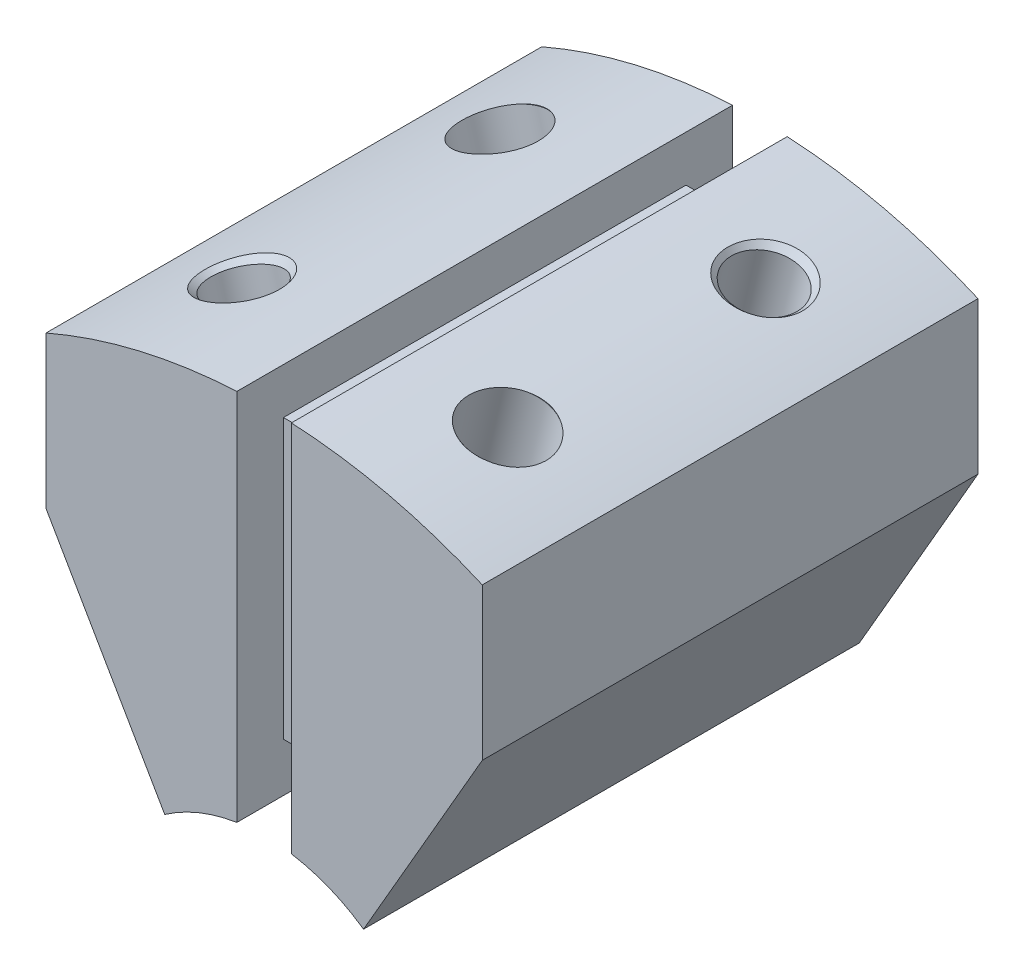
ISO-10303-21;
HEADER;
FILE_DESCRIPTION(('STEP AP214'),'2;1');
FILE_NAME('part.step','',(''),(''),'','','');
FILE_SCHEMA(('AUTOMOTIVE_DESIGN { 1 0 10303 214 1 1 1 1 }'));
ENDSEC;
DATA;
#1=APPLICATION_CONTEXT('core data for automotive mechanical design processes');
#2=APPLICATION_PROTOCOL_DEFINITION('international standard','automotive_design',2000,#1);
#3=PRODUCT_CONTEXT('',#1,'mechanical');
#4=PRODUCT('Part','Part','',(#3));
#5=PRODUCT_RELATED_PRODUCT_CATEGORY('part','',(#4));
#6=PRODUCT_DEFINITION_FORMATION('','',#4);
#7=PRODUCT_DEFINITION_CONTEXT('part definition',#1,'design');
#8=PRODUCT_DEFINITION('design','',#6,#7);
#9=PRODUCT_DEFINITION_SHAPE('','',#8);
#10=(LENGTH_UNIT() NAMED_UNIT(*) SI_UNIT(.MILLI.,.METRE.));
#11=(NAMED_UNIT(*) PLANE_ANGLE_UNIT() SI_UNIT($,.RADIAN.));
#12=(NAMED_UNIT(*) SI_UNIT($,.STERADIAN.) SOLID_ANGLE_UNIT());
#13=UNCERTAINTY_MEASURE_WITH_UNIT(LENGTH_MEASURE(1.E-05),#10,'distance_accuracy_value','');
#14=(GEOMETRIC_REPRESENTATION_CONTEXT(3) GLOBAL_UNCERTAINTY_ASSIGNED_CONTEXT((#13)) GLOBAL_UNIT_ASSIGNED_CONTEXT((#10,
#11,#12)) REPRESENTATION_CONTEXT('',''));
#15=CARTESIAN_POINT('',(0.,0.,0.));
#16=DIRECTION('',(0.,0.,1.));
#17=DIRECTION('',(1.,0.,0.));
#18=AXIS2_PLACEMENT_3D('',#15,#16,#17);
#19=CARTESIAN_POINT('',(-2.74999999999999,50.3,25.));
#20=DIRECTION('',(0.,-1.,0.));
#21=DIRECTION('',(0.,0.,-1.));
#22=AXIS2_PLACEMENT_3D('',#19,#20,#21);
#23=PLANE('',#22);
#24=DIRECTION('',(1.,0.,0.));
#25=VECTOR('',#24,1.);
#26=CARTESIAN_POINT('',(-2.75,50.3,-20.3));
#27=LINE('',#26,#25);
#28=CARTESIAN_POINT('',(-2.75,50.3,-20.3));
#29=VERTEX_POINT('',#28);
#30=CARTESIAN_POINT('',(2.75,50.3,-20.3));
#31=VERTEX_POINT('',#30);
#32=EDGE_CURVE('E217',#29,#31,#27,.T.);
#33=ORIENTED_EDGE('',*,*,#32,.F.);
#34=DIRECTION('',(0.,0.,-1.));
#35=VECTOR('',#34,1.);
#36=CARTESIAN_POINT('',(-2.74999999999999,50.3,25.));
#37=LINE('',#36,#35);
#38=CARTESIAN_POINT('',(-2.75,50.3,20.3));
#39=VERTEX_POINT('',#38);
#40=EDGE_CURVE('E283',#39,#29,#37,.T.);
#41=ORIENTED_EDGE('',*,*,#40,.F.);
#42=DIRECTION('',(-1.,0.,0.));
#43=VECTOR('',#42,1.);
#44=CARTESIAN_POINT('',(2.75,50.3,20.3));
#45=LINE('',#44,#43);
#46=CARTESIAN_POINT('',(2.75,50.3,20.3));
#47=VERTEX_POINT('',#46);
#48=EDGE_CURVE('E225',#47,#39,#45,.T.);
#49=ORIENTED_EDGE('',*,*,#48,.F.);
#50=DIRECTION('',(0.,0.,-1.));
#51=VECTOR('',#50,1.);
#52=CARTESIAN_POINT('',(2.74999999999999,50.3,25.));
#53=LINE('',#52,#51);
#54=EDGE_CURVE('E290',#47,#31,#53,.T.);
#55=ORIENTED_EDGE('',*,*,#54,.T.);
#56=EDGE_LOOP('',(#33,#41,#49,#55));
#57=FACE_BOUND('',#56,.T.);
#58=ADVANCED_FACE('F44',(#57),#23,.F.);
#59=CARTESIAN_POINT('',(0.,0.,25.));
#60=DIRECTION('',(0.,0.,1.));
#61=DIRECTION('',(1.,0.,0.));
#62=AXIS2_PLACEMENT_3D('',#59,#60,#61);
#63=PLANE('',#62);
#64=DIRECTION('',(0.,1.,0.));
#65=VECTOR('',#64,1.);
#66=CARTESIAN_POINT('',(-2.75,17.2825779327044,25.));
#67=LINE('',#66,#65);
#68=CARTESIAN_POINT('',(-2.75,17.2825779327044,25.));
#69=VERTEX_POINT('',#68);
#70=CARTESIAN_POINT('',(-2.75,54.931206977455,25.));
#71=VERTEX_POINT('',#70);
#72=EDGE_CURVE('E250',#69,#71,#67,.T.);
#73=ORIENTED_EDGE('',*,*,#72,.T.);
#74=CARTESIAN_POINT('',(0.,0.,25.));
#75=DIRECTION('',(0.,0.,1.));
#76=DIRECTION('',(1.,0.,0.));
#77=AXIS2_PLACEMENT_3D('',#74,#75,#76);
#78=CIRCLE('',#77,55.);
#79=CARTESIAN_POINT('',(-22.,50.4083326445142,25.));
#80=VERTEX_POINT('',#79);
#81=EDGE_CURVE('E236',#71,#80,#78,.T.);
#82=ORIENTED_EDGE('',*,*,#81,.T.);
#83=DIRECTION('',(0.,-1.,0.));
#84=VECTOR('',#83,1.);
#85=CARTESIAN_POINT('',(-22.,50.4083326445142,25.));
#86=LINE('',#85,#84);
#87=CARTESIAN_POINT('',(-22.,35.0814245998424,25.));
#88=VERTEX_POINT('',#87);
#89=EDGE_CURVE('E242',#80,#88,#86,.T.);
#90=ORIENTED_EDGE('',*,*,#89,.T.);
#91=DIRECTION('',(0.500000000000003,-0.866025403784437,0.));
#92=VECTOR('',#91,1.);
#93=CARTESIAN_POINT('',(-22.,35.0814245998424,25.));
#94=LINE('',#93,#92);
#95=CARTESIAN_POINT('',(-10.0265838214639,14.3428594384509,25.));
#96=VERTEX_POINT('',#95);
#97=EDGE_CURVE('E241',#88,#96,#94,.T.);
#98=ORIENTED_EDGE('',*,*,#97,.T.);
#99=CARTESIAN_POINT('',(0.,0.,25.));
#100=DIRECTION('',(0.,0.,-1.));
#101=DIRECTION('',(1.,0.,0.));
#102=AXIS2_PLACEMENT_3D('',#99,#100,#101);
#103=CIRCLE('',#102,17.5);
#104=EDGE_CURVE('E249',#96,#69,#103,.T.);
#105=ORIENTED_EDGE('',*,*,#104,.T.);
#106=EDGE_LOOP('',(#73,#82,#90,#98,#105));
#107=FACE_BOUND('',#106,.T.);
#108=ADVANCED_FACE('F423',(#107),#63,.T.);
#109=CARTESIAN_POINT('',(0.,0.,-25.));
#110=DIRECTION('',(0.,0.,1.));
#111=DIRECTION('',(1.,0.,0.));
#112=AXIS2_PLACEMENT_3D('',#109,#110,#111);
#113=PLANE('',#112);
#114=DIRECTION('',(0.,1.,0.));
#115=VECTOR('',#114,1.);
#116=CARTESIAN_POINT('',(-2.75,54.931206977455,-25.));
#117=LINE('',#116,#115);
#118=CARTESIAN_POINT('',(-2.75,17.2825779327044,-25.));
#119=VERTEX_POINT('',#118);
#120=CARTESIAN_POINT('',(-2.75,54.931206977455,-25.));
#121=VERTEX_POINT('',#120);
#122=EDGE_CURVE('E244',#119,#121,#117,.T.);
#123=ORIENTED_EDGE('',*,*,#122,.F.);
#124=CARTESIAN_POINT('',(0.,0.,-25.));
#125=DIRECTION('',(0.,0.,-1.));
#126=DIRECTION('',(1.,0.,0.));
#127=AXIS2_PLACEMENT_3D('',#124,#125,#126);
#128=CIRCLE('',#127,17.5);
#129=CARTESIAN_POINT('',(-10.0265838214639,14.3428594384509,-25.));
#130=VERTEX_POINT('',#129);
#131=EDGE_CURVE('E268',#130,#119,#128,.T.);
#132=ORIENTED_EDGE('',*,*,#131,.F.);
#133=DIRECTION('',(0.500000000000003,-0.866025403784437,0.));
#134=VECTOR('',#133,1.);
#135=CARTESIAN_POINT('',(-22.,35.0814245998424,-25.));
#136=LINE('',#135,#134);
#137=CARTESIAN_POINT('',(-22.,35.0814245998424,-25.));
#138=VERTEX_POINT('',#137);
#139=EDGE_CURVE('E266',#138,#130,#136,.T.);
#140=ORIENTED_EDGE('',*,*,#139,.F.);
#141=DIRECTION('',(0.,-1.,0.));
#142=VECTOR('',#141,1.);
#143=CARTESIAN_POINT('',(-22.,50.4083326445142,-25.));
#144=LINE('',#143,#142);
#145=CARTESIAN_POINT('',(-22.,50.4083326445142,-25.));
#146=VERTEX_POINT('',#145);
#147=EDGE_CURVE('E262',#146,#138,#144,.T.);
#148=ORIENTED_EDGE('',*,*,#147,.F.);
#149=CARTESIAN_POINT('',(0.,0.,-25.));
#150=DIRECTION('',(0.,0.,1.));
#151=DIRECTION('',(1.,0.,0.));
#152=AXIS2_PLACEMENT_3D('',#149,#150,#151);
#153=CIRCLE('',#152,55.);
#154=EDGE_CURVE('E240',#121,#146,#153,.T.);
#155=ORIENTED_EDGE('',*,*,#154,.F.);
#156=EDGE_LOOP('',(#123,#132,#140,#148,#155));
#157=FACE_BOUND('',#156,.T.);
#158=ADVANCED_FACE('F428',(#157),#113,.F.);
#159=CARTESIAN_POINT('',(0.,0.,25.));
#160=DIRECTION('',(0.,0.,-1.));
#161=DIRECTION('',(-1.,0.,0.));
#162=AXIS2_PLACEMENT_3D('',#159,#160,#161);
#163=CYLINDRICAL_SURFACE('',#162,55.);
#164=CARTESIAN_POINT('',(-16.8341064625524,52.3604130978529,10.1136202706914));
#165=CARTESIAN_POINT('',(-16.7024164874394,52.4027515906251,9.97462887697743));
#166=CARTESIAN_POINT('',(-16.5607073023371,52.4477624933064,9.84589542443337));
#167=CARTESIAN_POINT('',(-16.259968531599,52.5417762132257,9.61214926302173));
#168=CARTESIAN_POINT('',(-16.1009294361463,52.590781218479,9.50714967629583));
#169=CARTESIAN_POINT('',(-15.7491491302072,52.6972660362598,9.31286783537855));
#170=CARTESIAN_POINT('',(-15.5546471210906,52.7550622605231,9.22691879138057));
#171=CARTESIAN_POINT('',(-15.1536110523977,52.8716525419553,9.09139164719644));
#172=CARTESIAN_POINT('',(-14.9470759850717,52.9304466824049,9.04181659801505));
#173=CARTESIAN_POINT('',(-14.5342485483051,53.0452653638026,8.981758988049));
#174=CARTESIAN_POINT('',(-14.3281237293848,53.1013207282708,8.97018168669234));
#175=CARTESIAN_POINT('',(-13.9163548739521,53.2107172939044,8.98345370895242));
#176=CARTESIAN_POINT('',(-13.7107107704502,53.2640588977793,9.00829761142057));
#177=CARTESIAN_POINT('',(-13.3083016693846,53.3660164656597,9.09300314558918));
#178=CARTESIAN_POINT('',(-13.1114600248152,53.4146812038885,9.15244359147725));
#179=CARTESIAN_POINT('',(-12.729543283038,53.5069842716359,9.30399788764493));
#180=CARTESIAN_POINT('',(-12.5444688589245,53.5506223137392,9.39611360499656));
#181=CARTESIAN_POINT('',(-12.1884985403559,53.6327734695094,9.61159690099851));
#182=CARTESIAN_POINT('',(-12.0178426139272,53.6712045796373,9.73539161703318));
#183=CARTESIAN_POINT('',(-11.6981212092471,53.741797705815,10.0097354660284));
#184=CARTESIAN_POINT('',(-11.5490587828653,53.7739588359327,10.1602883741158));
#185=CARTESIAN_POINT('',(-11.2718616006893,53.8327584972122,10.4889224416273));
#186=CARTESIAN_POINT('',(-11.1445348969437,53.8591909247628,10.6677219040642));
#187=CARTESIAN_POINT('',(-10.9198556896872,53.9051940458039,11.0440484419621));
#188=CARTESIAN_POINT('',(-10.8225080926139,53.9247636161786,11.2415785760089));
#189=CARTESIAN_POINT('',(-10.6574325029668,53.9576360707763,11.6566705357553));
#190=CARTESIAN_POINT('',(-10.5907725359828,53.9707140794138,11.8746752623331));
#191=CARTESIAN_POINT('',(-10.4934766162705,53.9897158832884,12.3188846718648));
#192=CARTESIAN_POINT('',(-10.4628452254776,53.9956387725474,12.5450903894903));
#193=CARTESIAN_POINT('',(-10.4380900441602,54.000430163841,13.0043026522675));
#194=CARTESIAN_POINT('',(-10.4447389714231,53.9991493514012,13.2373527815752));
#195=CARTESIAN_POINT('',(-10.496189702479,53.9891718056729,13.6990553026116));
#196=CARTESIAN_POINT('',(-10.5409936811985,53.9804746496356,13.9277074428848));
#197=CARTESIAN_POINT('',(-10.6678720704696,53.955543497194,14.374909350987));
#198=CARTESIAN_POINT('',(-10.7500799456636,53.9392825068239,14.5934198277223));
#199=CARTESIAN_POINT('',(-10.9497003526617,53.8991129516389,15.0129834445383));
#200=CARTESIAN_POINT('',(-11.0671113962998,53.8752047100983,15.2140373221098));
#201=CARTESIAN_POINT('',(-11.3320258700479,53.8200999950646,15.5896432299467));
#202=CARTESIAN_POINT('',(-11.4790604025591,53.789016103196,15.7645421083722));
#203=CARTESIAN_POINT('',(-11.8002219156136,53.7194720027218,16.0856720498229));
#204=CARTESIAN_POINT('',(-11.9743443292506,53.6810130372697,16.2319079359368));
#205=CARTESIAN_POINT('',(-12.3389623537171,53.5983566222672,16.4867206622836));
#206=CARTESIAN_POINT('',(-12.5288002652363,53.5543688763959,16.596306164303));
#207=CARTESIAN_POINT('',(-12.9236047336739,53.4604669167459,16.7799215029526));
#208=CARTESIAN_POINT('',(-13.1285678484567,53.4105540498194,16.8539594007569));
#209=CARTESIAN_POINT('',(-13.540129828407,53.3076759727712,16.9618649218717));
#210=CARTESIAN_POINT('',(-13.7464318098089,53.2548740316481,16.9970224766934));
#211=CARTESIAN_POINT('',(-14.1611644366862,53.1460943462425,17.0303730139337));
#212=CARTESIAN_POINT('',(-14.3695947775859,53.0901170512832,17.0285712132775));
#213=CARTESIAN_POINT('',(-14.7783275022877,52.9777793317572,16.9884820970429));
#214=CARTESIAN_POINT('',(-14.9787091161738,52.9214482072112,16.9509146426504));
#215=CARTESIAN_POINT('',(-15.3700206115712,52.8091273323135,16.841642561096));
#216=CARTESIAN_POINT('',(-15.5609504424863,52.7531375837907,16.7699377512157));
#217=CARTESIAN_POINT('',(-15.9294570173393,52.6430399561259,16.5942255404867));
#218=CARTESIAN_POINT('',(-16.1069426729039,52.5889460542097,16.4900187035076));
#219=CARTESIAN_POINT('',(-16.4428071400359,52.4849031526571,16.2527646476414));
#220=CARTESIAN_POINT('',(-16.6011836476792,52.4349546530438,16.1197139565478));
#221=CARTESIAN_POINT('',(-16.899241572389,52.3396678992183,15.8246828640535));
#222=CARTESIAN_POINT('',(-17.0382834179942,52.2944957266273,15.6620030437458));
#223=CARTESIAN_POINT('',(-17.28918810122,52.2120815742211,15.3151108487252));
#224=CARTESIAN_POINT('',(-17.4010464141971,52.1748409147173,15.1308948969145));
#225=CARTESIAN_POINT('',(-17.598528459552,52.1085699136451,14.7394426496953));
#226=CARTESIAN_POINT('',(-17.6831320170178,52.0798614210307,14.5316369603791));
#227=CARTESIAN_POINT('',(-17.8189625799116,52.0335444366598,14.1042211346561));
#228=CARTESIAN_POINT('',(-17.8701856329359,52.0159372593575,13.8846096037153));
#229=CARTESIAN_POINT('',(-17.9390678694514,51.9922228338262,13.4338396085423));
#230=CARTESIAN_POINT('',(-17.9558419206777,51.9864188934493,13.2025295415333));
#231=CARTESIAN_POINT('',(-17.9528271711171,51.987459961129,12.7401272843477));
#232=CARTESIAN_POINT('',(-17.9330298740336,51.9943079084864,12.5090351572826));
#233=CARTESIAN_POINT('',(-17.8569194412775,52.0204964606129,12.0513808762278));
#234=CARTESIAN_POINT('',(-17.8002580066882,52.0399562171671,11.8248834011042));
#235=CARTESIAN_POINT('',(-17.6513335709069,52.0906572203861,11.3854095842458));
#236=CARTESIAN_POINT('',(-17.5590966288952,52.1218898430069,11.1724234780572));
#237=CARTESIAN_POINT('',(-17.3663498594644,52.1863740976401,10.8131463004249));
#238=CARTESIAN_POINT('',(-17.2726287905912,52.2175069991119,10.6627864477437));
#239=CARTESIAN_POINT('',(-17.0667668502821,52.2851528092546,10.3766306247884));
#240=CARTESIAN_POINT('',(-16.9546329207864,52.3216636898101,10.2408291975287));
#241=CARTESIAN_POINT('',(-16.8341064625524,52.3604130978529,10.1136202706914));
#242=B_SPLINE_CURVE_WITH_KNOTS('',3,(#164,#165,#166,#167,#168,#169,#170,#171,#172,#173,#174,
#175,#176,#177,#178,#179,#180,#181,#182,#183,#184,#185,#186,#187,#188,#189,#190,#191,#192,#193,
#194,#195,#196,#197,#198,#199,#200,#201,#202,#203,#204,#205,#206,#207,#208,#209,#210,#211,#212,
#213,#214,#215,#216,#217,#218,#219,#220,#221,#222,#223,#224,#225,#226,#227,#228,#229,#230,#231,
#232,#233,#234,#235,#236,#237,#238,#239,#240,#241),.UNSPECIFIED.,.T.,.F.,(4,2,2,2,2,2,2,2,2,2,2,
2,2,2,2,2,2,2,2,2,2,2,2,2,2,2,2,2,2,2,2,2,2,2,2,2,2,2,4),(0.,0.587778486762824,1.17588115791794,
1.83362004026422,2.49141408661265,3.13008213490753,3.76865512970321,4.3996119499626,
5.03060482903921,5.67060045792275,6.31068645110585,6.97095464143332,7.63133083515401,
8.31321636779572,8.99518823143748,9.69134704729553,10.3875455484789,11.0862479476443,
11.7849208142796,12.4732988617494,13.1615609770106,13.8289245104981,14.4961366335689,
15.1404786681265,15.7847297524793,16.4162820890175,17.0478378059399,17.6833477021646,
18.318934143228,18.9721308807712,19.6254362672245,20.3009326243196,20.9765089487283,
21.6692367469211,22.3621255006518,23.0616577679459,23.7606785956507,24.2988328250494,
24.83678462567),.UNSPECIFIED.);
#243=CARTESIAN_POINT('',(-16.8341064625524,52.3604130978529,10.1136202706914));
#244=VERTEX_POINT('',#243);
#245=EDGE_CURVE('E56',#244,#244,#242,.T.);
#246=ORIENTED_EDGE('',*,*,#245,.T.);
#247=EDGE_LOOP('',(#246));
#248=FACE_BOUND('',#247,.T.);
#249=CARTESIAN_POINT('',(-15.8302017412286,52.6726182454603,-9.35985920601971));
#250=CARTESIAN_POINT('',(-15.9283572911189,52.6431206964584,-9.40651253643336));
#251=CARTESIAN_POINT('',(-16.0245314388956,52.6139153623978,-9.45750462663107));
#252=CARTESIAN_POINT('',(-16.2122798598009,52.5563655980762,-9.5677588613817));
#253=CARTESIAN_POINT('',(-16.3038543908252,52.5280211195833,-9.62702054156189));
#254=CARTESIAN_POINT('',(-16.4817157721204,52.472485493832,-9.75336784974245));
#255=CARTESIAN_POINT('',(-16.5680062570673,52.4452935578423,-9.8204480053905));
#256=CARTESIAN_POINT('',(-16.7347605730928,52.3923224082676,-9.96195336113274));
#257=CARTESIAN_POINT('',(-16.8152244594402,52.3665431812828,-10.0363784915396));
#258=CARTESIAN_POINT('',(-17.0471098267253,52.291704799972,-10.269994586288));
#259=CARTESIAN_POINT('',(-17.1891059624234,52.2451195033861,-10.4395838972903));
#260=CARTESIAN_POINT('',(-17.4436589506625,52.1606829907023,-10.8013163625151));
#261=CARTESIAN_POINT('',(-17.5562213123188,52.12283014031,-10.9934552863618));
#262=CARTESIAN_POINT('',(-17.7490261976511,52.0574918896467,-11.3949991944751));
#263=CARTESIAN_POINT('',(-17.8292658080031,52.0300074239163,-11.6044057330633));
#264=CARTESIAN_POINT('',(-17.9552090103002,51.9866804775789,-12.0345274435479));
#265=CARTESIAN_POINT('',(-18.000908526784,51.9708393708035,-12.2552439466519));
#266=CARTESIAN_POINT('',(-18.0564544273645,51.9515671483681,-12.7011632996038));
#267=CARTESIAN_POINT('',(-18.0663822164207,51.948107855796,-12.9263547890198));
#268=CARTESIAN_POINT('',(-18.0503389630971,51.9536844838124,-13.3752915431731));
#269=CARTESIAN_POINT('',(-18.0243692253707,51.9627199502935,-13.599036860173));
#270=CARTESIAN_POINT('',(-17.9372961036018,51.9928408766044,-14.0384472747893));
#271=CARTESIAN_POINT('',(-17.8762368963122,52.0139111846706,-14.2541221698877));
#272=CARTESIAN_POINT('',(-17.7206667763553,52.0671171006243,-14.671594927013));
#273=CARTESIAN_POINT('',(-17.6261558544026,52.099252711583,-14.873392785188));
#274=CARTESIAN_POINT('',(-17.4060340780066,52.1732061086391,-15.2577760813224));
#275=CARTESIAN_POINT('',(-17.2803676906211,52.2150411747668,-15.4403263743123));
#276=CARTESIAN_POINT('',(-17.0014036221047,52.3065362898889,-15.7806448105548));
#277=CARTESIAN_POINT('',(-16.8481123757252,52.35619451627,-15.9384187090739));
#278=CARTESIAN_POINT('',(-16.5537459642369,52.449899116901,-16.1938135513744));
#279=CARTESIAN_POINT('',(-16.4171755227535,52.4928433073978,-16.2970676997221));
#280=CARTESIAN_POINT('',(-16.2033593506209,52.5590783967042,-16.4370963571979));
#281=CARTESIAN_POINT('',(-16.1306107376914,52.5814548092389,-16.4812891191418));
#282=CARTESIAN_POINT('',(-15.9823826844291,52.6266991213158,-16.5645798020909));
#283=CARTESIAN_POINT('',(-15.9069027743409,52.6495671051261,-16.6036768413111));
#284=CARTESIAN_POINT('',(-15.8302017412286,52.6726182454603,-16.6401407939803));
#285=B_SPLINE_CURVE_WITH_KNOTS('',3,(#249,#250,#251,#252,#253,#254,#255,#256,#257,#258,#259,
#260,#261,#262,#263,#264,#265,#266,#267,#268,#269,#270,#271,#272,#273,#274,#275,#276,#277,#278,
#279,#280,#281,#282,#283,#284),.UNSPECIFIED.,.F.,.F.,(4,2,2,2,2,2,2,2,2,2,2,2,2,2,2,2,2,4),(0.,
0.337720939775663,0.675422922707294,1.01288994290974,1.35035376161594,2.02497753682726,
2.69947495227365,3.37403314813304,4.04867092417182,4.72177246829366,5.39484954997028,
6.06708109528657,6.73931282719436,7.41275150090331,8.08603351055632,8.61399336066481,
8.87785807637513,9.14176839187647),.UNSPECIFIED.);
#286=CARTESIAN_POINT('',(-15.8302017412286,52.6726182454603,-9.35985920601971));
#287=VERTEX_POINT('',#286);
#288=CARTESIAN_POINT('',(-15.8302017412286,52.6726182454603,-16.6401407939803));
#289=VERTEX_POINT('',#288);
#290=EDGE_CURVE('E351',#287,#289,#285,.T.);
#291=ORIENTED_EDGE('',*,*,#290,.T.);
#292=CARTESIAN_POINT('',(-16.7979097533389,52.3720367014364,-15.9240673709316));
#293=CARTESIAN_POINT('',(-16.6643439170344,52.4148764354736,-16.0612490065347));
#294=CARTESIAN_POINT('',(-16.520860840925,52.4603326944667,-16.188008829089));
#295=CARTESIAN_POINT('',(-16.2168350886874,52.5551102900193,-16.417505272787));
#296=CARTESIAN_POINT('',(-16.0562830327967,52.6044337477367,-16.5202285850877));
#297=CARTESIAN_POINT('',(-15.7020046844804,52.7113369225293,-16.7092156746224));
#298=CARTESIAN_POINT('',(-15.5065914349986,52.7692099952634,-16.7921794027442));
#299=CARTESIAN_POINT('',(-15.1042418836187,52.8857798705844,-16.9216440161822));
#300=CARTESIAN_POINT('',(-14.8973046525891,52.9444767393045,-16.9681419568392));
#301=CARTESIAN_POINT('',(-14.4841072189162,53.0589792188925,-17.022170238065));
#302=CARTESIAN_POINT('',(-14.2779971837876,53.1148194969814,-17.0307778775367));
#303=CARTESIAN_POINT('',(-13.8667436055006,53.22366632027,-17.0116621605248));
#304=CARTESIAN_POINT('',(-13.6615999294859,53.2766732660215,-16.9839439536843));
#305=CARTESIAN_POINT('',(-13.2604271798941,53.3779302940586,-16.8936693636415));
#306=CARTESIAN_POINT('',(-13.0643231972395,53.426225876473,-16.8314954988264));
#307=CARTESIAN_POINT('',(-12.6843045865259,53.5177228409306,-16.6746756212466));
#308=CARTESIAN_POINT('',(-12.5003907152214,53.5609239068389,-16.5800275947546));
#309=CARTESIAN_POINT('',(-12.1469651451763,53.6421910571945,-16.3596086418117));
#310=CARTESIAN_POINT('',(-11.9777153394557,53.6801689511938,-16.2333858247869));
#311=CARTESIAN_POINT('',(-11.6611742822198,53.7498217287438,-15.9544655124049));
#312=CARTESIAN_POINT('',(-11.5138861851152,53.7814957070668,-15.801764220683));
#313=CARTESIAN_POINT('',(-11.2405649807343,53.8392967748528,-15.4690373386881));
#314=CARTESIAN_POINT('',(-11.1153595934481,53.8652147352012,-15.2882956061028));
#315=CARTESIAN_POINT('',(-10.8952217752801,53.9101734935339,-14.9084594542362));
#316=CARTESIAN_POINT('',(-10.8002942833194,53.9292131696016,-14.7093620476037));
#317=CARTESIAN_POINT('',(-10.6404047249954,53.9609922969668,-14.2915592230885));
#318=CARTESIAN_POINT('',(-10.576509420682,53.9735084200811,-14.0724282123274));
#319=CARTESIAN_POINT('',(-10.4849151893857,53.9913765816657,-13.6264414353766));
#320=CARTESIAN_POINT('',(-10.4572207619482,53.9967277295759,-13.3995847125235));
#321=CARTESIAN_POINT('',(-10.4385109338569,54.0003481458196,-12.9397058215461));
#322=CARTESIAN_POINT('',(-10.448246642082,53.9984723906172,-12.7066515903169));
#323=CARTESIAN_POINT('',(-10.5058546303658,53.9872935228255,-12.2454723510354));
#324=CARTESIAN_POINT('',(-10.5537289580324,53.9779900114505,-12.0173476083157));
#325=CARTESIAN_POINT('',(-10.6866142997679,53.9518382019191,-11.5719017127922));
#326=CARTESIAN_POINT('',(-10.771731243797,53.9349683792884,-11.3546133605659));
#327=CARTESIAN_POINT('',(-10.9769391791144,53.8935776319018,-10.9379987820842));
#328=CARTESIAN_POINT('',(-11.097028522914,53.8690570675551,-10.7386717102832));
#329=CARTESIAN_POINT('',(-11.3668502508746,53.8127619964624,-10.3671035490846));
#330=CARTESIAN_POINT('',(-11.5160956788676,53.7811054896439,-10.1944913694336));
#331=CARTESIAN_POINT('',(-11.8412562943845,53.7104481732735,-9.87831116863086));
#332=CARTESIAN_POINT('',(-12.0171668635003,53.6714486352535,-9.73473812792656));
#333=CARTESIAN_POINT('',(-12.3847371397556,53.5878032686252,-9.4855270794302));
#334=CARTESIAN_POINT('',(-12.5757443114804,53.5433685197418,-9.37885623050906));
#335=CARTESIAN_POINT('',(-12.9723617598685,53.4486605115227,-9.20123195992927));
#336=CARTESIAN_POINT('',(-13.1779687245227,53.3983885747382,-9.13027046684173));
#337=CARTESIAN_POINT('',(-13.5903050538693,53.2949081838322,-9.02844993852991));
#338=CARTESIAN_POINT('',(-13.7967577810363,53.2418580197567,-8.99630759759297));
#339=CARTESIAN_POINT('',(-14.2112876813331,53.1327131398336,-8.96894139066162));
#340=CARTESIAN_POINT('',(-14.4193646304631,53.0766188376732,-8.97371252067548));
#341=CARTESIAN_POINT('',(-14.8271197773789,52.9641429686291,-9.01955118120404));
#342=CARTESIAN_POINT('',(-15.0268823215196,52.9077865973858,-9.05993512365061));
#343=CARTESIAN_POINT('',(-15.4165312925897,52.7955651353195,-9.17466628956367));
#344=CARTESIAN_POINT('',(-15.6064176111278,52.7397000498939,-9.24901388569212));
#345=CARTESIAN_POINT('',(-15.972653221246,52.6299459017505,-9.42987279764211));
#346=CARTESIAN_POINT('',(-16.1488932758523,52.5760742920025,-9.53661551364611));
#347=CARTESIAN_POINT('',(-16.4819117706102,52.4726313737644,-9.77868720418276));
#348=CARTESIAN_POINT('',(-16.6386878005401,52.4230605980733,-9.91401971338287));
#349=CARTESIAN_POINT('',(-16.933280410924,52.3286600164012,-10.2134536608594));
#350=CARTESIAN_POINT('',(-17.0704352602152,52.2840039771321,-10.3782605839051));
#351=CARTESIAN_POINT('',(-17.317274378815,52.2027675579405,-10.7290644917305));
#352=CARTESIAN_POINT('',(-17.426954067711,52.1661885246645,-10.9150650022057));
#353=CARTESIAN_POINT('',(-17.6197515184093,52.1013924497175,-11.3097405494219));
#354=CARTESIAN_POINT('',(-17.7018437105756,52.0735006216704,-11.5189702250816));
#355=CARTESIAN_POINT('',(-17.8324557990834,52.0289179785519,-11.9487883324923));
#356=CARTESIAN_POINT('',(-17.8809717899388,52.012228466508,-12.1693780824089));
#357=CARTESIAN_POINT('',(-17.9442112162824,51.9904458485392,-12.6215244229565));
#358=CARTESIAN_POINT('',(-17.9580655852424,51.9856510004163,-12.8532173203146));
#359=CARTESIAN_POINT('',(-17.9491635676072,51.988725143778,-13.3158643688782));
#360=CARTESIAN_POINT('',(-17.9263987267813,51.9965970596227,-13.546818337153));
#361=CARTESIAN_POINT('',(-17.8443706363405,52.024804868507,-14.0034974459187));
#362=CARTESIAN_POINT('',(-17.7847852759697,52.0452507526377,-14.2291579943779));
#363=CARTESIAN_POINT('',(-17.6301512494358,52.0978348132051,-14.6664327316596));
#364=CARTESIAN_POINT('',(-17.5351289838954,52.1299642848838,-14.8780572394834));
#365=CARTESIAN_POINT('',(-17.3378669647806,52.1958471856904,-15.2340695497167));
#366=CARTESIAN_POINT('',(-17.2424238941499,52.2274920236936,-15.3826611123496));
#367=CARTESIAN_POINT('',(-17.0333709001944,52.2960454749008,-15.6650788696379));
#368=CARTESIAN_POINT('',(-16.9197677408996,52.3329521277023,-15.7989105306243));
#369=CARTESIAN_POINT('',(-16.7979097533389,52.3720367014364,-15.9240673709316));
#370=B_SPLINE_CURVE_WITH_KNOTS('',3,(#292,#293,#294,#295,#296,#297,#298,#299,#300,#301,#302,
#303,#304,#305,#306,#307,#308,#309,#310,#311,#312,#313,#314,#315,#316,#317,#318,#319,#320,#321,
#322,#323,#324,#325,#326,#327,#328,#329,#330,#331,#332,#333,#334,#335,#336,#337,#338,#339,#340,
#341,#342,#343,#344,#345,#346,#347,#348,#349,#350,#351,#352,#353,#354,#355,#356,#357,#358,#359,
#360,#361,#362,#363,#364,#365,#366,#367,#368,#369),.UNSPECIFIED.,.T.,.F.,(4,2,2,2,2,2,2,2,2,2,2,
2,2,2,2,2,2,2,2,2,2,2,2,2,2,2,2,2,2,2,2,2,2,2,2,2,2,2,4),(0.,0.58808731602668,1.17649948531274,
1.83329150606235,2.49013655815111,3.12818030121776,3.76613360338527,4.39714241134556,
5.02819035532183,5.66884564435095,6.30959286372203,6.97077582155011,7.63206657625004,
8.31471412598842,8.99744651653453,9.69395008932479,10.390491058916,11.0890262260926,
11.7875284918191,12.4752324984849,13.162817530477,13.8292097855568,14.4954513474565,
15.139005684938,15.7824727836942,16.4138510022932,17.0452361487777,17.6812419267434,
18.317326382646,18.971403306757,19.6255892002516,20.3019342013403,20.9783578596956,
21.6715787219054,22.3649596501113,23.0644939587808,23.7635081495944,24.3002455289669,
24.836783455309),.UNSPECIFIED.);
#371=CARTESIAN_POINT('',(-12.6269522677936,53.5309263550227,-16.6401407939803));
#372=VERTEX_POINT('',#371);
#373=EDGE_CURVE('E329',#289,#372,#370,.T.);
#374=ORIENTED_EDGE('',*,*,#373,.T.);
#375=CARTESIAN_POINT('',(-12.6269522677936,53.5309263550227,-16.6401407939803));
#376=CARTESIAN_POINT('',(-12.5271982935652,53.5544585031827,-16.5934874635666));
#377=CARTESIAN_POINT('',(-12.429306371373,53.5772530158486,-16.5424953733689));
#378=CARTESIAN_POINT('',(-12.2379365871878,53.621287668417,-16.4322411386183));
#379=CARTESIAN_POINT('',(-12.1444584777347,53.6425278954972,-16.3729794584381));
#380=CARTESIAN_POINT('',(-11.9626581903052,53.6833633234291,-16.2466321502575));
#381=CARTESIAN_POINT('',(-11.8743324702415,53.7029596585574,-16.1795519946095));
#382=CARTESIAN_POINT('',(-11.7034334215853,53.7404624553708,-16.0380466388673));
#383=CARTESIAN_POINT('',(-11.6208600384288,53.7583689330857,-15.9636215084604));
#384=CARTESIAN_POINT('',(-11.3826222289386,53.809499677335,-15.730005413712));
#385=CARTESIAN_POINT('',(-11.2363573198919,53.8401536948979,-15.5604161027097));
#386=CARTESIAN_POINT('',(-10.9736897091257,53.8943060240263,-15.1986836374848));
#387=CARTESIAN_POINT('',(-10.8572814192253,53.917805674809,-15.0065447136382));
#388=CARTESIAN_POINT('',(-10.657638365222,53.9576235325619,-14.6050008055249));
#389=CARTESIAN_POINT('',(-10.5744065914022,53.9739410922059,-14.3955942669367));
#390=CARTESIAN_POINT('',(-10.4436731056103,53.999390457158,-13.9654725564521));
#391=CARTESIAN_POINT('',(-10.396175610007,54.0085214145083,-13.7447560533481));
#392=CARTESIAN_POINT('',(-10.3384353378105,54.0196041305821,-13.2988367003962));
#393=CARTESIAN_POINT('',(-10.3281079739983,54.0215721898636,-13.0736452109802));
#394=CARTESIAN_POINT('',(-10.3447901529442,54.0183800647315,-12.6247084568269));
#395=CARTESIAN_POINT('',(-10.3717983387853,54.013220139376,-12.400963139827));
#396=CARTESIAN_POINT('',(-10.4622663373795,53.9957690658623,-11.9615527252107));
#397=CARTESIAN_POINT('',(-10.5256803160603,53.9834868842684,-11.7458778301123));
#398=CARTESIAN_POINT('',(-10.6870109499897,53.9517794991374,-11.328405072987));
#399=CARTESIAN_POINT('',(-10.7849276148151,53.9323542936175,-11.126607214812));
#400=CARTESIAN_POINT('',(-11.0125353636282,53.8863389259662,-10.7422239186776));
#401=CARTESIAN_POINT('',(-11.1422831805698,53.8597359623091,-10.5596736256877));
#402=CARTESIAN_POINT('',(-11.4296207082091,53.7994910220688,-10.2193551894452));
#403=CARTESIAN_POINT('',(-11.587203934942,53.7658506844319,-10.0615812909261));
#404=CARTESIAN_POINT('',(-11.8889850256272,53.6998180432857,-9.8061864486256));
#405=CARTESIAN_POINT('',(-12.0287305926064,53.6687235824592,-9.70293230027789));
#406=CARTESIAN_POINT('',(-12.2470183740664,53.6191767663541,-9.5629036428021));
#407=CARTESIAN_POINT('',(-12.3212087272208,53.60218100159,-9.51871088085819));
#408=CARTESIAN_POINT('',(-12.4722001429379,53.5672496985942,-9.43542019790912));
#409=CARTESIAN_POINT('',(-12.5490016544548,53.5493139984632,-9.39632315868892));
#410=CARTESIAN_POINT('',(-12.6269522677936,53.5309263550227,-9.35985920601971));
#411=B_SPLINE_CURVE_WITH_KNOTS('',3,(#375,#376,#377,#378,#379,#380,#381,#382,#383,#384,#385,
#386,#387,#388,#389,#390,#391,#392,#393,#394,#395,#396,#397,#398,#399,#400,#401,#402,#403,#404,
#405,#406,#407,#408,#409,#410),.UNSPECIFIED.,.F.,.F.,(4,2,2,2,2,2,2,2,2,2,2,2,2,2,2,2,2,4),(0.,
0.337720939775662,0.675422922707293,1.01288994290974,1.35035376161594,2.02497753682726,
2.69947495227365,3.37403314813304,4.04867092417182,4.72177246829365,5.39484954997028,
6.06708109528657,6.73931282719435,7.41275150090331,8.08603351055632,8.61399336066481,
8.87785807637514,9.14176839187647),.UNSPECIFIED.);
#412=CARTESIAN_POINT('',(-12.6269522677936,53.5309263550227,-9.35985920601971));
#413=VERTEX_POINT('',#412);
#414=EDGE_CURVE('E328',#372,#413,#411,.T.);
#415=ORIENTED_EDGE('',*,*,#414,.T.);
#416=EDGE_CURVE('E325',#413,#287,#370,.T.);
#417=ORIENTED_EDGE('',*,*,#416,.T.);
#418=EDGE_LOOP('',(#291,#374,#415,#417));
#419=FACE_BOUND('',#418,.T.);
#420=ORIENTED_EDGE('',*,*,#154,.T.);
#421=DIRECTION('',(0.,0.,-1.));
#422=VECTOR('',#421,1.);
#423=CARTESIAN_POINT('',(-22.,50.4083326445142,25.));
#424=LINE('',#423,#422);
#425=EDGE_CURVE('E317',#80,#146,#424,.T.);
#426=ORIENTED_EDGE('',*,*,#425,.F.);
#427=ORIENTED_EDGE('',*,*,#81,.F.);
#428=DIRECTION('',(0.,0.,-1.));
#429=VECTOR('',#428,1.);
#430=CARTESIAN_POINT('',(-2.75,54.931206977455,25.));
#431=LINE('',#430,#429);
#432=EDGE_CURVE('E261',#71,#121,#431,.T.);
#433=ORIENTED_EDGE('',*,*,#432,.T.);
#434=EDGE_LOOP('',(#420,#426,#427,#433));
#435=FACE_BOUND('',#434,.T.);
#436=ADVANCED_FACE('F50',(#248,#419,#435),#163,.T.);
#437=CARTESIAN_POINT('',(-22.,50.4083326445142,25.));
#438=DIRECTION('',(1.,0.,0.));
#439=DIRECTION('',(0.,0.,-1.));
#440=AXIS2_PLACEMENT_3D('',#437,#438,#439);
#441=PLANE('',#440);
#442=ORIENTED_EDGE('',*,*,#147,.T.);
#443=DIRECTION('',(0.,0.,-1.));
#444=VECTOR('',#443,1.);
#445=CARTESIAN_POINT('',(-22.,35.0814245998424,25.));
#446=LINE('',#445,#444);
#447=EDGE_CURVE('E316',#88,#138,#446,.T.);
#448=ORIENTED_EDGE('',*,*,#447,.F.);
#449=ORIENTED_EDGE('',*,*,#89,.F.);
#450=ORIENTED_EDGE('',*,*,#425,.T.);
#451=EDGE_LOOP('',(#442,#448,#449,#450));
#452=FACE_BOUND('',#451,.T.);
#453=ADVANCED_FACE('F480',(#452),#441,.F.);
#454=CARTESIAN_POINT('',(-22.,35.0814245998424,25.));
#455=DIRECTION('',(0.866025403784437,0.500000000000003,0.));
#456=DIRECTION('',(-0.500000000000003,0.866025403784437,0.));
#457=AXIS2_PLACEMENT_3D('',#454,#455,#456);
#458=PLANE('',#457);
#459=ORIENTED_EDGE('',*,*,#139,.T.);
#460=DIRECTION('',(0.,0.,-1.));
#461=VECTOR('',#460,1.);
#462=CARTESIAN_POINT('',(-10.0265838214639,14.3428594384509,25.));
#463=LINE('',#462,#461);
#464=EDGE_CURVE('E311',#96,#130,#463,.T.);
#465=ORIENTED_EDGE('',*,*,#464,.F.);
#466=ORIENTED_EDGE('',*,*,#97,.F.);
#467=ORIENTED_EDGE('',*,*,#447,.T.);
#468=EDGE_LOOP('',(#459,#465,#466,#467));
#469=FACE_BOUND('',#468,.T.);
#470=ADVANCED_FACE('F482',(#469),#458,.F.);
#471=CARTESIAN_POINT('',(0.,0.,25.));
#472=DIRECTION('',(0.,0.,-1.));
#473=DIRECTION('',(-1.,0.,0.));
#474=AXIS2_PLACEMENT_3D('',#471,#472,#473);
#475=CYLINDRICAL_SURFACE('',#474,17.5);
#476=ORIENTED_EDGE('',*,*,#131,.T.);
#477=DIRECTION('',(0.,0.,-1.));
#478=VECTOR('',#477,1.);
#479=CARTESIAN_POINT('',(-2.75,17.2825779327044,25.));
#480=LINE('',#479,#478);
#481=EDGE_CURVE('E313',#69,#119,#480,.T.);
#482=ORIENTED_EDGE('',*,*,#481,.F.);
#483=ORIENTED_EDGE('',*,*,#104,.F.);
#484=ORIENTED_EDGE('',*,*,#464,.T.);
#485=EDGE_LOOP('',(#476,#482,#483,#484));
#486=FACE_BOUND('',#485,.T.);
#487=ADVANCED_FACE('F485',(#486),#475,.F.);
#488=CARTESIAN_POINT('',(-2.74999999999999,22.2,25.));
#489=DIRECTION('',(0.,1.,0.));
#490=DIRECTION('',(0.,0.,1.));
#491=AXIS2_PLACEMENT_3D('',#488,#489,#490);
#492=PLANE('',#491);
#493=DIRECTION('',(0.,0.,-1.));
#494=VECTOR('',#493,1.);
#495=CARTESIAN_POINT('',(-2.74999999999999,22.2,25.));
#496=LINE('',#495,#494);
#497=CARTESIAN_POINT('',(-2.74999999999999,22.2,20.3));
#498=VERTEX_POINT('',#497);
#499=CARTESIAN_POINT('',(-2.75,22.2,-20.3));
#500=VERTEX_POINT('',#499);
#501=EDGE_CURVE('E306',#498,#500,#496,.T.);
#502=ORIENTED_EDGE('',*,*,#501,.T.);
#503=DIRECTION('',(1.,0.,0.));
#504=VECTOR('',#503,1.);
#505=CARTESIAN_POINT('',(-2.75000000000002,22.2,-20.3));
#506=LINE('',#505,#504);
#507=CARTESIAN_POINT('',(2.74999999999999,22.2,-20.3));
#508=VERTEX_POINT('',#507);
#509=EDGE_CURVE('E233',#500,#508,#506,.T.);
#510=ORIENTED_EDGE('',*,*,#509,.T.);
#511=DIRECTION('',(0.,0.,-1.));
#512=VECTOR('',#511,1.);
#513=CARTESIAN_POINT('',(2.74999999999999,22.2,25.));
#514=LINE('',#513,#512);
#515=CARTESIAN_POINT('',(2.75,22.2,20.3));
#516=VERTEX_POINT('',#515);
#517=EDGE_CURVE('E302',#516,#508,#514,.T.);
#518=ORIENTED_EDGE('',*,*,#517,.F.);
#519=DIRECTION('',(-1.,0.,0.));
#520=VECTOR('',#519,1.);
#521=CARTESIAN_POINT('',(-2.74999999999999,22.2,20.3));
#522=LINE('',#521,#520);
#523=EDGE_CURVE('E223',#516,#498,#522,.T.);
#524=ORIENTED_EDGE('',*,*,#523,.T.);
#525=EDGE_LOOP('',(#502,#510,#518,#524));
#526=FACE_BOUND('',#525,.T.);
#527=ADVANCED_FACE('F462',(#526),#492,.F.);
#528=CARTESIAN_POINT('',(0.,0.,25.));
#529=DIRECTION('',(0.,0.,-1.));
#530=DIRECTION('',(-1.,0.,0.));
#531=AXIS2_PLACEMENT_3D('',#528,#529,#530);
#532=CYLINDRICAL_SURFACE('',#531,17.5);
#533=CARTESIAN_POINT('',(0.,0.,-25.));
#534=DIRECTION('',(0.,0.,-1.));
#535=DIRECTION('',(1.,0.,0.));
#536=AXIS2_PLACEMENT_3D('',#533,#534,#535);
#537=CIRCLE('',#536,17.5);
#538=CARTESIAN_POINT('',(2.74999999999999,17.2825779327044,-25.));
#539=VERTEX_POINT('',#538);
#540=CARTESIAN_POINT('',(10.0265838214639,14.3428594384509,-25.));
#541=VERTEX_POINT('',#540);
#542=EDGE_CURVE('E271',#539,#541,#537,.T.);
#543=ORIENTED_EDGE('',*,*,#542,.T.);
#544=DIRECTION('',(0.,0.,-1.));
#545=VECTOR('',#544,1.);
#546=CARTESIAN_POINT('',(10.0265838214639,14.3428594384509,25.));
#547=LINE('',#546,#545);
#548=CARTESIAN_POINT('',(10.0265838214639,14.3428594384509,25.));
#549=VERTEX_POINT('',#548);
#550=EDGE_CURVE('E298',#549,#541,#547,.T.);
#551=ORIENTED_EDGE('',*,*,#550,.F.);
#552=CARTESIAN_POINT('',(0.,0.,25.));
#553=DIRECTION('',(0.,0.,-1.));
#554=DIRECTION('',(1.,0.,0.));
#555=AXIS2_PLACEMENT_3D('',#552,#553,#554);
#556=CIRCLE('',#555,17.5);
#557=CARTESIAN_POINT('',(2.74999999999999,17.2825779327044,25.));
#558=VERTEX_POINT('',#557);
#559=EDGE_CURVE('E252',#558,#549,#556,.T.);
#560=ORIENTED_EDGE('',*,*,#559,.F.);
#561=DIRECTION('',(0.,0.,-1.));
#562=VECTOR('',#561,1.);
#563=CARTESIAN_POINT('',(2.74999999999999,17.2825779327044,25.));
#564=LINE('',#563,#562);
#565=EDGE_CURVE('E305',#558,#539,#564,.T.);
#566=ORIENTED_EDGE('',*,*,#565,.T.);
#567=EDGE_LOOP('',(#543,#551,#560,#566));
#568=FACE_BOUND('',#567,.T.);
#569=ADVANCED_FACE('F497',(#568),#532,.F.);
#570=CARTESIAN_POINT('',(22.,35.0814245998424,25.));
#571=DIRECTION('',(-0.866025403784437,0.500000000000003,0.));
#572=DIRECTION('',(-0.500000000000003,-0.866025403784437,0.));
#573=AXIS2_PLACEMENT_3D('',#570,#571,#572);
#574=PLANE('',#573);
#575=DIRECTION('',(0.500000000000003,0.866025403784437,0.));
#576=VECTOR('',#575,1.);
#577=CARTESIAN_POINT('',(22.,35.0814245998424,-25.));
#578=LINE('',#577,#576);
#579=CARTESIAN_POINT('',(22.,35.0814245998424,-25.));
#580=VERTEX_POINT('',#579);
#581=EDGE_CURVE('E272',#541,#580,#578,.T.);
#582=ORIENTED_EDGE('',*,*,#581,.T.);
#583=DIRECTION('',(0.,0.,-1.));
#584=VECTOR('',#583,1.);
#585=CARTESIAN_POINT('',(22.,35.0814245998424,25.));
#586=LINE('',#585,#584);
#587=CARTESIAN_POINT('',(22.,35.0814245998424,25.));
#588=VERTEX_POINT('',#587);
#589=EDGE_CURVE('E299',#588,#580,#586,.T.);
#590=ORIENTED_EDGE('',*,*,#589,.F.);
#591=DIRECTION('',(0.500000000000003,0.866025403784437,0.));
#592=VECTOR('',#591,1.);
#593=CARTESIAN_POINT('',(22.,35.0814245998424,25.));
#594=LINE('',#593,#592);
#595=EDGE_CURVE('E255',#549,#588,#594,.T.);
#596=ORIENTED_EDGE('',*,*,#595,.F.);
#597=ORIENTED_EDGE('',*,*,#550,.T.);
#598=EDGE_LOOP('',(#582,#590,#596,#597));
#599=FACE_BOUND('',#598,.T.);
#600=ADVANCED_FACE('F499',(#599),#574,.F.);
#601=CARTESIAN_POINT('',(22.,50.4083326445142,25.));
#602=DIRECTION('',(-1.,0.,0.));
#603=DIRECTION('',(0.,0.,1.));
#604=AXIS2_PLACEMENT_3D('',#601,#602,#603);
#605=PLANE('',#604);
#606=DIRECTION('',(0.,1.,0.));
#607=VECTOR('',#606,1.);
#608=CARTESIAN_POINT('',(22.,50.4083326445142,-25.));
#609=LINE('',#608,#607);
#610=CARTESIAN_POINT('',(22.,50.4083326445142,-25.));
#611=VERTEX_POINT('',#610);
#612=EDGE_CURVE('E274',#580,#611,#609,.T.);
#613=ORIENTED_EDGE('',*,*,#612,.T.);
#614=DIRECTION('',(0.,0.,-1.));
#615=VECTOR('',#614,1.);
#616=CARTESIAN_POINT('',(22.,50.4083326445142,25.));
#617=LINE('',#616,#615);
#618=CARTESIAN_POINT('',(22.,50.4083326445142,25.));
#619=VERTEX_POINT('',#618);
#620=EDGE_CURVE('E294',#619,#611,#617,.T.);
#621=ORIENTED_EDGE('',*,*,#620,.F.);
#622=DIRECTION('',(0.,1.,0.));
#623=VECTOR('',#622,1.);
#624=CARTESIAN_POINT('',(22.,50.4083326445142,25.));
#625=LINE('',#624,#623);
#626=EDGE_CURVE('E258',#588,#619,#625,.T.);
#627=ORIENTED_EDGE('',*,*,#626,.F.);
#628=ORIENTED_EDGE('',*,*,#589,.T.);
#629=EDGE_LOOP('',(#613,#621,#627,#628));
#630=FACE_BOUND('',#629,.T.);
#631=ADVANCED_FACE('F443',(#630),#605,.F.);
#632=CARTESIAN_POINT('',(0.,0.,25.));
#633=DIRECTION('',(0.,0.,-1.));
#634=DIRECTION('',(-1.,0.,0.));
#635=AXIS2_PLACEMENT_3D('',#632,#633,#634);
#636=CYLINDRICAL_SURFACE('',#635,55.);
#637=CARTESIAN_POINT('',(10.3788973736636,54.0118365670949,-16.2815952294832));
#638=CARTESIAN_POINT('',(10.5349971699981,53.9818399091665,-16.3983794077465));
#639=CARTESIAN_POINT('',(10.6997179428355,53.9494822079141,-16.5031135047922));
#640=CARTESIAN_POINT('',(11.0427161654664,53.8803214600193,-16.6856428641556));
#641=CARTESIAN_POINT('',(11.2210013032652,53.8435158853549,-16.7634227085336));
#642=CARTESIAN_POINT('',(11.6042012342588,53.7622944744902,-16.8957187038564));
#643=CARTESIAN_POINT('',(11.8100408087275,53.7174881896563,-16.9473440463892));
#644=CARTESIAN_POINT('',(12.2267777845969,53.6241689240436,-17.0136725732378));
#645=CARTESIAN_POINT('',(12.437675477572,53.5756557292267,-17.02837362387));
#646=CARTESIAN_POINT('',(12.8534957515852,53.4773997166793,-17.0204148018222));
#647=CARTESIAN_POINT('',(13.058446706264,53.427708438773,-16.9985807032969));
#648=CARTESIAN_POINT('',(13.4613066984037,53.3276318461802,-16.9198860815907));
#649=CARTESIAN_POINT('',(13.6592162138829,53.2772465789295,-16.8630279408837));
#650=CARTESIAN_POINT('',(14.0426667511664,53.1774652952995,-16.7162025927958));
#651=CARTESIAN_POINT('',(14.2282035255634,53.1280696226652,-16.6262240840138));
#652=CARTESIAN_POINT('',(14.5820814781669,53.0320334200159,-16.4160788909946));
#653=CARTESIAN_POINT('',(14.7504208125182,52.9853931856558,-16.2959089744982));
#654=CARTESIAN_POINT('',(15.0696733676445,52.8954927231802,-16.0258193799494));
#655=CARTESIAN_POINT('',(15.2200703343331,52.8523407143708,-15.875253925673));
#656=CARTESIAN_POINT('',(15.4951377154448,52.7723533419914,-15.5507707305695));
#657=CARTESIAN_POINT('',(15.619804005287,52.7355189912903,-15.3768492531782));
#658=CARTESIAN_POINT('',(15.8444856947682,52.6684586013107,-15.0042488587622));
#659=CARTESIAN_POINT('',(15.9435182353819,52.6384999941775,-14.8049290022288));
#660=CARTESIAN_POINT('',(16.1090658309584,52.5880739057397,-14.3920923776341));
#661=CARTESIAN_POINT('',(16.1755759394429,52.5676078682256,-14.1785734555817));
#662=CARTESIAN_POINT('',(16.2761006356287,52.5365723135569,-13.7369208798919));
#663=CARTESIAN_POINT('',(16.3091428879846,52.5262990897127,-13.5085446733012));
#664=CARTESIAN_POINT('',(16.3386751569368,52.5171203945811,-13.0492068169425));
#665=CARTESIAN_POINT('',(16.3351616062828,52.5182160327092,-12.8182449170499));
#666=CARTESIAN_POINT('',(16.291360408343,52.5318199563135,-12.3570773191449));
#667=CARTESIAN_POINT('',(16.2505879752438,52.5444786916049,-12.1269218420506));
#668=CARTESIAN_POINT('',(16.1324702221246,52.5808633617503,-11.6770900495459));
#669=CARTESIAN_POINT('',(16.0551243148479,52.604589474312,-11.4574139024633));
#670=CARTESIAN_POINT('',(15.8660641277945,52.6619186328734,-11.0360496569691));
#671=CARTESIAN_POINT('',(15.7545181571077,52.6954732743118,-10.8342795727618));
#672=CARTESIAN_POINT('',(15.4995582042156,52.7710271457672,-10.4537408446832));
#673=CARTESIAN_POINT('',(15.3561474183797,52.8130255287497,-10.2749698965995));
#674=CARTESIAN_POINT('',(15.0446710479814,52.902584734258,-9.9500061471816));
#675=CARTESIAN_POINT('',(14.8772387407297,52.9499977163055,-9.80316616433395));
#676=CARTESIAN_POINT('',(14.5198052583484,53.0491239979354,-9.54198616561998));
#677=CARTESIAN_POINT('',(14.3298088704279,53.1008363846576,-9.42763927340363));
#678=CARTESIAN_POINT('',(13.9394830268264,53.2046065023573,-9.23885236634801));
#679=CARTESIAN_POINT('',(13.739730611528,53.2565917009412,-9.16317932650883));
#680=CARTESIAN_POINT('',(13.3299511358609,53.3606317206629,-9.04868965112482));
#681=CARTESIAN_POINT('',(13.1199261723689,53.4126865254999,-9.00986552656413));
#682=CARTESIAN_POINT('',(12.7022437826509,53.5135290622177,-8.97108887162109));
#683=CARTESIAN_POINT('',(12.4947023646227,53.562367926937,-8.97001226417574));
#684=CARTESIAN_POINT('',(12.0818955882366,53.6569905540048,-9.0039213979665));
#685=CARTESIAN_POINT('',(11.8766300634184,53.7027745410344,-9.03890448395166));
#686=CARTESIAN_POINT('',(11.4759520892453,53.7898154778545,-9.14326273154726));
#687=CARTESIAN_POINT('',(11.2804723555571,53.8311066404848,-9.21235195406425));
#688=CARTESIAN_POINT('',(10.9029271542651,53.908843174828,-9.38247456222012));
#689=CARTESIAN_POINT('',(10.7208625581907,53.9452882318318,-9.48351002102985));
#690=CARTESIAN_POINT('',(10.3718725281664,54.0134841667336,-9.71637630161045));
#691=CARTESIAN_POINT('',(10.2052696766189,54.0451412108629,-9.84871749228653));
#692=CARTESIAN_POINT('',(9.89513711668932,54.1027836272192,-10.1391465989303));
#693=CARTESIAN_POINT('',(9.75161088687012,54.128768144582,-10.2972383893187));
#694=CARTESIAN_POINT('',(9.48682724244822,54.1758140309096,-10.6401954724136));
#695=CARTESIAN_POINT('',(9.36645118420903,54.1966866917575,-10.82576705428));
#696=CARTESIAN_POINT('',(9.15691524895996,54.2324832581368,-11.2142889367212));
#697=CARTESIAN_POINT('',(9.06776046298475,54.247406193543,-11.4172420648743));
#698=CARTESIAN_POINT('',(8.92046443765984,54.2718260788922,-11.8416346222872));
#699=CARTESIAN_POINT('',(8.86338905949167,54.2811372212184,-12.0634550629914));
#700=CARTESIAN_POINT('',(8.7860516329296,54.2937090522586,-12.513588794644));
#701=CARTESIAN_POINT('',(8.76579295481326,54.2969691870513,-12.7419026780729));
#702=CARTESIAN_POINT('',(8.76254526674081,54.297493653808,-13.2030332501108));
#703=CARTESIAN_POINT('',(8.78025092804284,54.2946462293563,-13.4358552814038));
#704=CARTESIAN_POINT('',(8.85393509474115,54.2826786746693,-13.8952566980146));
#705=CARTESIAN_POINT('',(8.90992176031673,54.2735572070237,-14.1218347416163));
#706=CARTESIAN_POINT('',(9.05886622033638,54.2488951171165,-14.5624639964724));
#707=CARTESIAN_POINT('',(9.1518724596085,54.2333460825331,-14.7764983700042));
#708=CARTESIAN_POINT('',(9.37243612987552,54.1956629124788,-15.1851921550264));
#709=CARTESIAN_POINT('',(9.49996316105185,54.1735345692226,-15.3798684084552));
#710=CARTESIAN_POINT('',(9.74962018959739,54.1290735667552,-15.6974681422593));
#711=CARTESIAN_POINT('',(9.86488884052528,54.1082213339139,-15.8260549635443));
#712=CARTESIAN_POINT('',(10.110848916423,54.0628002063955,-16.0667330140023));
#713=CARTESIAN_POINT('',(10.2415353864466,54.0382325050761,-16.1788295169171));
#714=CARTESIAN_POINT('',(10.3788973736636,54.0118365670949,-16.2815952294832));
#715=B_SPLINE_CURVE_WITH_KNOTS('',3,(#637,#638,#639,#640,#641,#642,#643,#644,#645,#646,#647,
#648,#649,#650,#651,#652,#653,#654,#655,#656,#657,#658,#659,#660,#661,#662,#663,#664,#665,#666,
#667,#668,#669,#670,#671,#672,#673,#674,#675,#676,#677,#678,#679,#680,#681,#682,#683,#684,#685,
#686,#687,#688,#689,#690,#691,#692,#693,#694,#695,#696,#697,#698,#699,#700,#701,#702,#703,#704,
#705,#706,#707,#708,#709,#710,#711,#712,#713,#714),.UNSPECIFIED.,.T.,.F.,(4,2,2,2,2,2,2,2,2,2,2,
2,2,2,2,2,2,2,2,2,2,2,2,2,2,2,2,2,2,2,2,2,2,2,2,2,2,2,4),(0.,0.591220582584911,1.18277878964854,
1.83020489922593,2.47766841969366,3.11069462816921,3.74367778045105,4.37687712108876,
5.01014428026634,5.6586362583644,6.30723210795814,6.97789224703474,7.64865435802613,
8.33838876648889,9.02819048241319,9.72709720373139,10.4260151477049,11.1215472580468,
11.8170096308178,12.4966913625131,13.1762291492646,13.8324853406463,14.4886081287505,
15.1251752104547,15.7616954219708,16.3929675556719,17.0242806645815,17.6666971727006,
18.3092104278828,18.9727276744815,19.6363530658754,20.3208911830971,21.0054919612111,
21.7027263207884,22.4001093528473,23.0984080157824,23.7960937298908,24.3165125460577,
24.8367645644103),.UNSPECIFIED.);
#716=CARTESIAN_POINT('',(10.3788973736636,54.0118365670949,-16.2815952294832));
#717=VERTEX_POINT('',#716);
#718=EDGE_CURVE('E11',#717,#717,#715,.T.);
#719=ORIENTED_EDGE('',*,*,#718,.T.);
#720=EDGE_LOOP('',(#719));
#721=FACE_BOUND('',#720,.T.);
#722=CARTESIAN_POINT('',(10.9600467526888,53.8969143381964,16.6401407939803));
#723=CARTESIAN_POINT('',(10.8596107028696,53.9173402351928,16.5934874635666));
#724=CARTESIAN_POINT('',(10.7610586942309,53.9370866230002,16.5424953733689));
#725=CARTESIAN_POINT('',(10.5684148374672,53.975162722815,16.4322411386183));
#726=CARTESIAN_POINT('',(10.4743227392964,53.9934925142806,16.3729794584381));
#727=CARTESIAN_POINT('',(10.2913430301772,54.0286678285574,16.2466321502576));
#728=CARTESIAN_POINT('',(10.202451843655,54.045514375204,16.1795519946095));
#729=CARTESIAN_POINT('',(10.0304715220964,54.0776968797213,16.0380466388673));
#730=CARTESIAN_POINT('',(9.94738233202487,54.0930328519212,15.9636215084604));
#731=CARTESIAN_POINT('',(9.70767285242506,54.1367475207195,15.730005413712));
#732=CARTESIAN_POINT('',(9.56052729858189,54.162848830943,15.5604161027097));
#733=CARTESIAN_POINT('',(9.29630603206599,54.2088256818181,15.1986836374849));
#734=CARTESIAN_POINT('',(9.17922469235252,54.2287023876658,15.0065447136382));
#735=CARTESIAN_POINT('',(8.97844237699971,54.2623070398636,14.6050008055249));
#736=CARTESIAN_POINT('',(8.89474441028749,54.2760344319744,14.3955942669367));
#737=CARTESIAN_POINT('',(8.76328427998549,54.2974154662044,13.9654725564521));
#738=CARTESIAN_POINT('',(8.71552635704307,54.3050683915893,13.7447560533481));
#739=CARTESIAN_POINT('',(8.65747003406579,54.3143543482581,13.2988367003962));
#740=CARTESIAN_POINT('',(8.64708658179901,54.3160010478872,13.0736452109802));
#741=CARTESIAN_POINT('',(8.66385976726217,54.3133280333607,12.6247084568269));
#742=CARTESIAN_POINT('',(8.69101504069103,54.3090085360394,12.400963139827));
#743=CARTESIAN_POINT('',(8.78198091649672,54.2943726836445,11.9615527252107));
#744=CARTESIAN_POINT('',(8.84574542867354,54.284063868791,11.7458778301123));
#745=CARTESIAN_POINT('',(9.00798213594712,54.2573771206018,11.328405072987));
#746=CARTESIAN_POINT('',(9.10645434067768,54.2409991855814,11.126607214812));
#747=CARTESIAN_POINT('',(9.33538016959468,54.2020676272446,10.7422239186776));
#748=CARTESIAN_POINT('',(9.46589089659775,54.1795029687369,10.5596736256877));
#749=CARTESIAN_POINT('',(9.75495923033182,54.1282018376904,10.2193551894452));
#750=CARTESIAN_POINT('',(9.91351030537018,54.0994668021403,10.0615812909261));
#751=CARTESIAN_POINT('',(10.2171948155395,54.042828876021,9.80618644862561));
#752=CARTESIAN_POINT('',(10.357837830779,54.0160850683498,9.70293230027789));
#753=CARTESIAN_POINT('',(10.5775577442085,53.9733346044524,9.56290364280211));
#754=CARTESIAN_POINT('',(10.6522396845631,53.9586488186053,9.5187108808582));
#755=CARTESIAN_POINT('',(10.8042421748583,53.9284189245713,9.43542019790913));
#756=CARTESIAN_POINT('',(10.8815631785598,53.912874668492,9.39632315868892));
#757=CARTESIAN_POINT('',(10.9600467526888,53.8969143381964,9.35985920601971));
#758=B_SPLINE_CURVE_WITH_KNOTS('',3,(#722,#723,#724,#725,#726,#727,#728,#729,#730,#731,#732,
#733,#734,#735,#736,#737,#738,#739,#740,#741,#742,#743,#744,#745,#746,#747,#748,#749,#750,#751,
#752,#753,#754,#755,#756,#757),.UNSPECIFIED.,.F.,.F.,(4,2,2,2,2,2,2,2,2,2,2,2,2,2,2,2,2,4),(0.,
0.337720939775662,0.675422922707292,1.01288994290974,1.35035376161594,2.02497753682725,
2.69947495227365,3.37403314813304,4.04867092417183,4.72177246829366,5.39484954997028,
6.06708109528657,6.73931282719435,7.41275150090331,8.08603351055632,8.61399336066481,
8.87785807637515,9.14176839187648),.UNSPECIFIED.);
#759=CARTESIAN_POINT('',(10.9600467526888,53.8969143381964,16.6401407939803));
#760=VERTEX_POINT('',#759);
#761=CARTESIAN_POINT('',(10.9600467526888,53.8969143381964,9.35985920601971));
#762=VERTEX_POINT('',#761);
#763=EDGE_CURVE('E394',#760,#762,#758,.T.);
#764=ORIENTED_EDGE('',*,*,#763,.T.);
#765=CARTESIAN_POINT('',(10.3722100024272,54.0131211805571,9.72341932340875));
#766=CARTESIAN_POINT('',(10.5280523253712,53.9831940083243,9.60630012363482));
#767=CARTESIAN_POINT('',(10.6925385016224,53.9509048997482,9.501207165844));
#768=CARTESIAN_POINT('',(11.0351222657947,53.8818765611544,9.31791881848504));
#769=CARTESIAN_POINT('',(11.2132275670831,53.845134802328,9.23973881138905));
#770=CARTESIAN_POINT('',(11.5961741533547,53.7640260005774,9.10655127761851));
#771=CARTESIAN_POINT('',(11.8019496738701,53.719266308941,9.05444146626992));
#772=CARTESIAN_POINT('',(12.2186420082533,53.6260231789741,8.98714350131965));
#773=CARTESIAN_POINT('',(12.4295591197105,53.577539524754,8.97195748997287));
#774=CARTESIAN_POINT('',(12.8454723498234,53.4793276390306,8.97897411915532));
#775=CARTESIAN_POINT('',(13.0504952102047,53.4296516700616,9.00034626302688));
#776=CARTESIAN_POINT('',(13.4535710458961,53.3295843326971,9.07814096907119));
#777=CARTESIAN_POINT('',(13.6516245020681,53.279193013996,9.13456110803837));
#778=CARTESIAN_POINT('',(14.0353931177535,53.1793860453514,9.28053500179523));
#779=CARTESIAN_POINT('',(14.2211062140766,53.1299705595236,9.37009428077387));
#780=CARTESIAN_POINT('',(14.5753969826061,53.033871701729,9.57943877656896));
#781=CARTESIAN_POINT('',(14.7439728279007,52.9871886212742,9.69922721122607));
#782=CARTESIAN_POINT('',(15.063737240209,52.8971843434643,9.96857627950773));
#783=CARTESIAN_POINT('',(15.2144133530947,52.8539702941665,10.1187806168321));
#784=CARTESIAN_POINT('',(15.4900893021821,52.7738362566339,10.4425927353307));
#785=CARTESIAN_POINT('',(15.6150850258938,52.7369172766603,10.6162042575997));
#786=CARTESIAN_POINT('',(15.8404782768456,52.6696648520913,10.988231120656));
#787=CARTESIAN_POINT('',(15.9398946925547,52.6395980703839,11.1872892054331));
#788=CARTESIAN_POINT('',(16.1062465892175,52.5889381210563,11.5996698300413));
#789=CARTESIAN_POINT('',(16.1731771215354,52.5683463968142,11.8129945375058));
#790=CARTESIAN_POINT('',(16.2745865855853,52.5370418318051,12.254343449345));
#791=CARTESIAN_POINT('',(16.3080913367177,52.5266257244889,12.4826129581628));
#792=CARTESIAN_POINT('',(16.3385629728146,52.5171554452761,12.9418190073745));
#793=CARTESIAN_POINT('',(16.3355262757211,52.518102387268,13.1727558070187));
#794=CARTESIAN_POINT('',(16.292687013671,52.5314083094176,13.6339832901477));
#795=CARTESIAN_POINT('',(16.2523955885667,52.5439190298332,13.864224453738));
#796=CARTESIAN_POINT('',(16.1352251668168,52.5800174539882,14.3143129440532));
#797=CARTESIAN_POINT('',(16.0583455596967,52.6036053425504,14.5341600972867));
#798=CARTESIAN_POINT('',(15.8701781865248,52.6606781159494,14.9559745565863));
#799=CARTESIAN_POINT('',(15.7590547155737,52.6941157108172,15.1580214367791));
#800=CARTESIAN_POINT('',(15.5048937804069,52.7694586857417,15.5391879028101));
#801=CARTESIAN_POINT('',(15.3618594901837,52.8113632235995,15.7183097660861));
#802=CARTESIAN_POINT('',(15.0510530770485,52.9007683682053,16.0440508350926));
#803=CARTESIAN_POINT('',(14.8839126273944,52.9481212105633,16.1913127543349));
#804=CARTESIAN_POINT('',(14.5269903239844,53.0471559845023,16.453383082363));
#805=CARTESIAN_POINT('',(14.3372132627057,53.098836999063,16.5681983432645));
#806=CARTESIAN_POINT('',(13.9472313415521,53.2025752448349,16.7579399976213));
#807=CARTESIAN_POINT('',(13.7476057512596,53.2545590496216,16.8340972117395));
#808=CARTESIAN_POINT('',(13.337996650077,53.3586209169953,16.9495654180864));
#809=CARTESIAN_POINT('',(13.1280152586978,53.4106989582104,16.9888839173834));
#810=CARTESIAN_POINT('',(12.7103546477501,53.5116031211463,17.0286245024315));
#811=CARTESIAN_POINT('',(12.5027942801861,53.5604799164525,17.030174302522));
#812=CARTESIAN_POINT('',(12.089872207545,53.6551941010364,16.9971936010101));
#813=CARTESIAN_POINT('',(11.8845103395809,53.7010317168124,16.9626657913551));
#814=CARTESIAN_POINT('',(11.483603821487,53.7881828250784,16.8591902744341));
#815=CARTESIAN_POINT('',(11.2879910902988,53.8295311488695,16.7905347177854));
#816=CARTESIAN_POINT('',(10.9101128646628,53.9073900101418,16.6212455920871));
#817=CARTESIAN_POINT('',(10.7278482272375,53.9439002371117,16.520609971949));
#818=CARTESIAN_POINT('',(10.3784205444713,54.0122270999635,16.2885226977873));
#819=CARTESIAN_POINT('',(10.2115763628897,54.043950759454,16.1565641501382));
#820=CARTESIAN_POINT('',(9.90090297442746,54.1017295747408,15.8668537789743));
#821=CARTESIAN_POINT('',(9.75707723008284,54.1277838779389,15.7090980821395));
#822=CARTESIAN_POINT('',(9.49164023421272,54.1749718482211,15.3667771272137));
#823=CARTESIAN_POINT('',(9.37090746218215,54.1959171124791,15.1815047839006));
#824=CARTESIAN_POINT('',(9.16061192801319,54.2318597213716,14.7935191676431));
#825=CARTESIAN_POINT('',(9.07105425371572,54.2468560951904,14.5908030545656));
#826=CARTESIAN_POINT('',(8.92289846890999,54.2714265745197,14.1668117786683));
#827=CARTESIAN_POINT('',(8.86536689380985,54.2808145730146,13.945152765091));
#828=CARTESIAN_POINT('',(8.78709254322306,54.2935409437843,13.4952639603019));
#829=CARTESIAN_POINT('',(8.76635315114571,54.2968787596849,13.2670335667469));
#830=CARTESIAN_POINT('',(8.76212157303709,54.2975620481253,12.8059652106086));
#831=CARTESIAN_POINT('',(8.77932780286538,54.2947951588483,12.5731203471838));
#832=CARTESIAN_POINT('',(8.85201960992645,54.2829907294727,12.113587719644));
#833=CARTESIAN_POINT('',(8.90751336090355,54.2739518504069,11.886901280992));
#834=CARTESIAN_POINT('',(9.05549961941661,54.2494565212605,11.4459433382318));
#835=CARTESIAN_POINT('',(9.14804495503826,54.2339909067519,11.2316900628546));
#836=CARTESIAN_POINT('',(9.36772822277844,54.196475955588,10.8224787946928));
#837=CARTESIAN_POINT('',(9.49483579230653,54.174432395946,10.6275040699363));
#838=CARTESIAN_POINT('',(9.74385783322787,54.1301106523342,10.3092554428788));
#839=CARTESIAN_POINT('',(9.85890678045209,54.1093111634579,10.1803412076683));
#840=CARTESIAN_POINT('',(10.1044767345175,54.0639910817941,9.93898679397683));
#841=CARTESIAN_POINT('',(10.2349927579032,54.039471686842,9.82654133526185));
#842=CARTESIAN_POINT('',(10.3722100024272,54.0131211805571,9.72341932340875));
#843=B_SPLINE_CURVE_WITH_KNOTS('',3,(#765,#766,#767,#768,#769,#770,#771,#772,#773,#774,#775,
#776,#777,#778,#779,#780,#781,#782,#783,#784,#785,#786,#787,#788,#789,#790,#791,#792,#793,#794,
#795,#796,#797,#798,#799,#800,#801,#802,#803,#804,#805,#806,#807,#808,#809,#810,#811,#812,#813,
#814,#815,#816,#817,#818,#819,#820,#821,#822,#823,#824,#825,#826,#827,#828,#829,#830,#831,#832,
#833,#834,#835,#836,#837,#838,#839,#840,#841,#842),.UNSPECIFIED.,.T.,.F.,(4,2,2,2,2,2,2,2,2,2,2,
2,2,2,2,2,2,2,2,2,2,2,2,2,2,2,2,2,2,2,2,2,2,2,2,2,2,2,4),(0.,0.591174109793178,1.18268555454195,
1.83024670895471,2.47784543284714,3.11092717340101,3.74396514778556,4.37710869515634,
5.01031966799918,5.65867946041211,6.30714300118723,6.97765974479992,7.6482785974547,
8.3379166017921,9.02762221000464,9.72650863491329,10.4254067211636,11.1210025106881,
11.8165291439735,12.4963470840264,13.1760213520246,13.8324313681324,14.4887075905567,
15.1253636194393,15.7619721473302,16.3932224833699,17.0245133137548,17.6668154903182,
18.3092141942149,18.9725842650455,19.6360625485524,20.3204847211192,21.0049698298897,
21.7021583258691,22.3994957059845,23.0978309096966,23.7955546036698,24.3162434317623,
24.8367649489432),.UNSPECIFIED.);
#844=CARTESIAN_POINT('',(14.1883836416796,53.1384020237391,9.35985920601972));
#845=VERTEX_POINT('',#844);
#846=EDGE_CURVE('E369',#762,#845,#843,.T.);
#847=ORIENTED_EDGE('',*,*,#846,.T.);
#848=CARTESIAN_POINT('',(14.1883836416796,53.1384020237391,9.35985920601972));
#849=CARTESIAN_POINT('',(14.287407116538,53.1119640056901,9.40651253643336));
#850=CARTESIAN_POINT('',(14.3844410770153,53.0857565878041,9.45750462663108));
#851=CARTESIAN_POINT('',(14.5738846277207,53.0340595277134,9.56775886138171));
#852=CARTESIAN_POINT('',(14.6662944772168,53.0085698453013,9.6270205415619));
#853=CARTESIAN_POINT('',(14.8457932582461,52.9585792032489,9.75336784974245));
#854=CARTESIAN_POINT('',(14.9328858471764,52.9340775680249,9.82044800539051));
#855=CARTESIAN_POINT('',(15.1012033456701,52.8863055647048,9.96195336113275));
#856=CARTESIAN_POINT('',(15.1824283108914,52.86303518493,10.0363784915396));
#857=CARTESIAN_POINT('',(15.4165239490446,52.7954272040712,10.269994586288));
#858=CARTESIAN_POINT('',(15.5598970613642,52.7532698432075,10.4395838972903));
#859=CARTESIAN_POINT('',(15.8169471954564,52.6767716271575,10.8013163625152));
#860=CARTESIAN_POINT('',(15.9306297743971,52.642429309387,10.9934552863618));
#861=CARTESIAN_POINT('',(16.1253689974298,52.5831043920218,11.3949991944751));
#862=CARTESIAN_POINT('',(16.2064227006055,52.5581226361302,11.6044057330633));
#863=CARTESIAN_POINT('',(16.3336495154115,52.5187240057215,12.0345274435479));
#864=CARTESIAN_POINT('',(16.3798185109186,52.504308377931,12.2552439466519));
#865=CARTESIAN_POINT('',(16.4359356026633,52.4867687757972,12.7011632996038));
#866=CARTESIAN_POINT('',(16.4459659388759,52.4836191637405,12.9263547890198));
#867=CARTESIAN_POINT('',(16.4297573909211,52.4886953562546,13.3752915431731));
#868=CARTESIAN_POINT('',(16.4035198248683,52.4969207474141,13.599036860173));
#869=CARTESIAN_POINT('',(16.3155541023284,52.5243256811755,14.0384472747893));
#870=CARTESIAN_POINT('',(16.2538705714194,52.5434914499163,14.2541221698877));
#871=CARTESIAN_POINT('',(16.09672460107,52.5918451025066,14.671594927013));
#872=CARTESIAN_POINT('',(16.0012621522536,52.6210329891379,14.873392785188));
#873=CARTESIAN_POINT('',(15.7789518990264,52.6881213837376,15.2577760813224));
#874=CARTESIAN_POINT('',(15.6520480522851,52.7260374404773,15.4403263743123));
#875=CARTESIAN_POINT('',(15.3703795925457,52.8088334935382,15.7806448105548));
#876=CARTESIAN_POINT('',(15.2156214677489,52.8537118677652,15.9384187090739));
#877=CARTESIAN_POINT('',(14.9184895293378,52.938238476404,16.1938135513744));
#878=CARTESIAN_POINT('',(14.7806524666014,52.9769248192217,16.2970676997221));
#879=CARTESIAN_POINT('',(14.5648842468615,53.0364942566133,16.4370963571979));
#880=CARTESIAN_POINT('',(14.491476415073,53.0566028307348,16.4812891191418));
#881=CARTESIAN_POINT('',(14.3419159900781,53.0972265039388,16.5645798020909));
#882=CARTESIAN_POINT('',(14.265762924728,53.1177416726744,16.6036768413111));
#883=CARTESIAN_POINT('',(14.1883836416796,53.1384020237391,16.6401407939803));
#884=B_SPLINE_CURVE_WITH_KNOTS('',3,(#848,#849,#850,#851,#852,#853,#854,#855,#856,#857,#858,
#859,#860,#861,#862,#863,#864,#865,#866,#867,#868,#869,#870,#871,#872,#873,#874,#875,#876,#877,
#878,#879,#880,#881,#882,#883),.UNSPECIFIED.,.F.,.F.,(4,2,2,2,2,2,2,2,2,2,2,2,2,2,2,2,2,4),(0.,
0.337720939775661,0.675422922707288,1.01288994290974,1.35035376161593,2.02497753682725,
2.69947495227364,3.37403314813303,4.04867092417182,4.72177246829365,5.39484954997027,
6.06708109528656,6.73931282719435,7.41275150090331,8.08603351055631,8.6139933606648,
8.87785807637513,9.14176839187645),.UNSPECIFIED.);
#885=CARTESIAN_POINT('',(14.1883836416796,53.1384020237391,16.6401407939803));
#886=VERTEX_POINT('',#885);
#887=EDGE_CURVE('E366',#845,#886,#884,.T.);
#888=ORIENTED_EDGE('',*,*,#887,.T.);
#889=EDGE_CURVE('E363',#886,#760,#843,.T.);
#890=ORIENTED_EDGE('',*,*,#889,.T.);
#891=EDGE_LOOP('',(#764,#847,#888,#890));
#892=FACE_BOUND('',#891,.T.);
#893=CARTESIAN_POINT('',(0.,0.,-25.));
#894=DIRECTION('',(0.,0.,1.));
#895=DIRECTION('',(1.,0.,0.));
#896=AXIS2_PLACEMENT_3D('',#893,#894,#895);
#897=CIRCLE('',#896,55.);
#898=CARTESIAN_POINT('',(2.75,54.931206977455,-25.));
#899=VERTEX_POINT('',#898);
#900=EDGE_CURVE('E280',#611,#899,#897,.T.);
#901=ORIENTED_EDGE('',*,*,#900,.T.);
#902=DIRECTION('',(0.,0.,-1.));
#903=VECTOR('',#902,1.);
#904=CARTESIAN_POINT('',(2.75,54.931206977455,25.));
#905=LINE('',#904,#903);
#906=CARTESIAN_POINT('',(2.75,54.931206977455,25.));
#907=VERTEX_POINT('',#906);
#908=EDGE_CURVE('E292',#907,#899,#905,.T.);
#909=ORIENTED_EDGE('',*,*,#908,.F.);
#910=CARTESIAN_POINT('',(0.,0.,25.));
#911=DIRECTION('',(0.,0.,1.));
#912=DIRECTION('',(1.,0.,0.));
#913=AXIS2_PLACEMENT_3D('',#910,#911,#912);
#914=CIRCLE('',#913,55.);
#915=EDGE_CURVE('E256',#619,#907,#914,.T.);
#916=ORIENTED_EDGE('',*,*,#915,.F.);
#917=ORIENTED_EDGE('',*,*,#620,.T.);
#918=EDGE_LOOP('',(#901,#909,#916,#917));
#919=FACE_BOUND('',#918,.T.);
#920=ADVANCED_FACE('F374',(#721,#892,#919),#636,.T.);
#921=CARTESIAN_POINT('',(2.75,54.931206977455,25.));
#922=DIRECTION('',(1.,0.,0.));
#923=DIRECTION('',(0.,1.,0.));
#924=AXIS2_PLACEMENT_3D('',#921,#922,#923);
#925=PLANE('',#924);
#926=DIRECTION('',(0.,-1.,0.));
#927=VECTOR('',#926,1.);
#928=CARTESIAN_POINT('',(2.75,54.931206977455,-25.));
#929=LINE('',#928,#927);
#930=EDGE_CURVE('E276',#899,#539,#929,.T.);
#931=ORIENTED_EDGE('',*,*,#930,.T.);
#932=ORIENTED_EDGE('',*,*,#565,.F.);
#933=DIRECTION('',(0.,-1.,0.));
#934=VECTOR('',#933,1.);
#935=CARTESIAN_POINT('',(2.75,17.2825779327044,25.));
#936=LINE('',#935,#934);
#937=EDGE_CURVE('E247',#907,#558,#936,.T.);
#938=ORIENTED_EDGE('',*,*,#937,.F.);
#939=ORIENTED_EDGE('',*,*,#908,.T.);
#940=EDGE_LOOP('',(#931,#932,#938,#939));
#941=FACE_BOUND('',#940,.T.);
#942=DIRECTION('',(0.,1.,0.));
#943=VECTOR('',#942,1.);
#944=CARTESIAN_POINT('',(2.75,14.3428594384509,-20.3));
#945=LINE('',#944,#943);
#946=EDGE_CURVE('E224',#508,#31,#945,.T.);
#947=ORIENTED_EDGE('',*,*,#946,.T.);
#948=ORIENTED_EDGE('',*,*,#54,.F.);
#949=DIRECTION('',(0.,1.,0.));
#950=VECTOR('',#949,1.);
#951=CARTESIAN_POINT('',(2.75,14.3428594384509,20.3));
#952=LINE('',#951,#950);
#953=EDGE_CURVE('E229',#516,#47,#952,.T.);
#954=ORIENTED_EDGE('',*,*,#953,.F.);
#955=ORIENTED_EDGE('',*,*,#517,.T.);
#956=EDGE_LOOP('',(#947,#948,#954,#955));
#957=FACE_BOUND('',#956,.T.);
#958=ADVANCED_FACE('F436',(#941,#957),#925,.F.);
#959=CARTESIAN_POINT('',(-2.75,54.931206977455,25.));
#960=DIRECTION('',(-1.,0.,0.));
#961=DIRECTION('',(0.,-1.,0.));
#962=AXIS2_PLACEMENT_3D('',#959,#960,#961);
#963=PLANE('',#962);
#964=ORIENTED_EDGE('',*,*,#40,.T.);
#965=DIRECTION('',(0.,1.,0.));
#966=VECTOR('',#965,1.);
#967=CARTESIAN_POINT('',(-2.75,14.3428594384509,-20.3));
#968=LINE('',#967,#966);
#969=EDGE_CURVE('E222',#500,#29,#968,.T.);
#970=ORIENTED_EDGE('',*,*,#969,.F.);
#971=ORIENTED_EDGE('',*,*,#501,.F.);
#972=DIRECTION('',(0.,1.,0.));
#973=VECTOR('',#972,1.);
#974=CARTESIAN_POINT('',(-2.75,14.3428594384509,20.3));
#975=LINE('',#974,#973);
#976=EDGE_CURVE('E220',#498,#39,#975,.T.);
#977=ORIENTED_EDGE('',*,*,#976,.T.);
#978=EDGE_LOOP('',(#964,#970,#971,#977));
#979=FACE_BOUND('',#978,.T.);
#980=ORIENTED_EDGE('',*,*,#122,.T.);
#981=ORIENTED_EDGE('',*,*,#432,.F.);
#982=ORIENTED_EDGE('',*,*,#72,.F.);
#983=ORIENTED_EDGE('',*,*,#481,.T.);
#984=EDGE_LOOP('',(#980,#981,#982,#983));
#985=FACE_BOUND('',#984,.T.);
#986=ADVANCED_FACE('F432',(#979,#985),#963,.F.);
#987=ORIENTED_EDGE('',*,*,#915,.T.);
#988=ORIENTED_EDGE('',*,*,#937,.T.);
#989=ORIENTED_EDGE('',*,*,#559,.T.);
#990=ORIENTED_EDGE('',*,*,#595,.T.);
#991=ORIENTED_EDGE('',*,*,#626,.T.);
#992=EDGE_LOOP('',(#987,#988,#989,#990,#991));
#993=FACE_BOUND('',#992,.T.);
#994=ADVANCED_FACE('F431',(#993),#63,.T.);
#995=ORIENTED_EDGE('',*,*,#542,.F.);
#996=ORIENTED_EDGE('',*,*,#930,.F.);
#997=ORIENTED_EDGE('',*,*,#900,.F.);
#998=ORIENTED_EDGE('',*,*,#612,.F.);
#999=ORIENTED_EDGE('',*,*,#581,.F.);
#1000=EDGE_LOOP('',(#995,#996,#997,#998,#999));
#1001=FACE_BOUND('',#1000,.T.);
#1002=ADVANCED_FACE('F514',(#1001),#113,.F.);
#1003=CARTESIAN_POINT('',(2.75,14.3428594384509,20.3));
#1004=DIRECTION('',(0.,0.,-1.));
#1005=DIRECTION('',(-1.,0.,0.));
#1006=AXIS2_PLACEMENT_3D('',#1003,#1004,#1005);
#1007=PLANE('',#1006);
#1008=ORIENTED_EDGE('',*,*,#953,.T.);
#1009=ORIENTED_EDGE('',*,*,#48,.T.);
#1010=ORIENTED_EDGE('',*,*,#976,.F.);
#1011=ORIENTED_EDGE('',*,*,#523,.F.);
#1012=EDGE_LOOP('',(#1008,#1009,#1010,#1011));
#1013=FACE_BOUND('',#1012,.T.);
#1014=ADVANCED_FACE('F459',(#1013),#1007,.F.);
#1015=CARTESIAN_POINT('',(-2.75,14.3428594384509,-20.3));
#1016=DIRECTION('',(0.,0.,1.));
#1017=DIRECTION('',(1.,0.,0.));
#1018=AXIS2_PLACEMENT_3D('',#1015,#1016,#1017);
#1019=PLANE('',#1018);
#1020=ORIENTED_EDGE('',*,*,#969,.T.);
#1021=ORIENTED_EDGE('',*,*,#32,.T.);
#1022=ORIENTED_EDGE('',*,*,#946,.F.);
#1023=ORIENTED_EDGE('',*,*,#509,.F.);
#1024=EDGE_LOOP('',(#1020,#1021,#1022,#1023));
#1025=FACE_BOUND('',#1024,.T.);
#1026=ADVANCED_FACE('F349',(#1025),#1019,.F.);
#1027=CARTESIAN_POINT('',(-14.2350474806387,53.1259204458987,-13.));
#1028=DIRECTION('',(-0.258819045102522,0.965925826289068,0.));
#1029=DIRECTION('',(-0.965925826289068,-0.258819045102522,0.));
#1030=AXIS2_PLACEMENT_3D('',#1027,#1028,#1029);
#1031=CYLINDRICAL_SURFACE('',#1030,3.99999999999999);
#1032=CARTESIAN_POINT('',(-10.3527618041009,38.6370330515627,-13.));
#1033=DIRECTION('',(-0.258819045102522,0.965925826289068,0.));
#1034=DIRECTION('',(-0.965925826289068,-0.258819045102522,0.));
#1035=AXIS2_PLACEMENT_3D('',#1032,#1033,#1034);
#1036=CIRCLE('',#1035,3.99999999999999);
#1037=CARTESIAN_POINT('',(-14.2164651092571,37.6017568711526,-13.));
#1038=VERTEX_POINT('',#1037);
#1039=EDGE_CURVE('E212',#1038,#1038,#1036,.T.);
#1040=ORIENTED_EDGE('',*,*,#1039,.F.);
#1041=EDGE_LOOP('',(#1040));
#1042=FACE_BOUND('',#1041,.T.);
#1043=CARTESIAN_POINT('',(-14.2285770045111,53.1017723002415,-13.));
#1044=DIRECTION('',(-0.258819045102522,0.965925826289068,0.));
#1045=DIRECTION('',(-0.965925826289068,-0.258819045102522,0.));
#1046=AXIS2_PLACEMENT_3D('',#1043,#1044,#1045);
#1047=CIRCLE('',#1046,3.99999999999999);
#1048=EDGE_CURVE('E75',#287,#413,#1047,.T.);
#1049=ORIENTED_EDGE('',*,*,#1048,.T.);
#1050=ORIENTED_EDGE('',*,*,#414,.F.);
#1051=EDGE_CURVE('E215',#372,#289,#1047,.T.);
#1052=ORIENTED_EDGE('',*,*,#1051,.T.);
#1053=ORIENTED_EDGE('',*,*,#290,.F.);
#1054=EDGE_LOOP('',(#1049,#1050,#1052,#1053));
#1055=FACE_BOUND('',#1054,.T.);
#1056=ADVANCED_FACE('F341',(#1042,#1055),#1031,.F.);
#1057=CARTESIAN_POINT('',(-14.2350474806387,53.1259204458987,-13.));
#1058=DIRECTION('',(-0.258819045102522,0.965925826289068,0.));
#1059=DIRECTION('',(-0.965925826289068,-0.258819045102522,0.));
#1060=AXIS2_PLACEMENT_3D('',#1057,#1058,#1059);
#1061=CONICAL_SURFACE('',#1060,4.025,0.785398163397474);
#1062=ORIENTED_EDGE('',*,*,#1051,.F.);
#1063=ORIENTED_EDGE('',*,*,#373,.F.);
#1064=EDGE_LOOP('',(#1062,#1063));
#1065=FACE_BOUND('',#1064,.T.);
#1066=ADVANCED_FACE('F339',(#1065),#1061,.F.);
#1067=ORIENTED_EDGE('',*,*,#1048,.F.);
#1068=ORIENTED_EDGE('',*,*,#416,.F.);
#1069=EDGE_LOOP('',(#1067,#1068));
#1070=FACE_BOUND('',#1069,.T.);
#1071=ADVANCED_FACE('F344',(#1070),#1061,.F.);
#1072=CARTESIAN_POINT('',(-10.3527618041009,38.6370330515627,-13.));
#1073=DIRECTION('',(-0.258819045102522,0.965925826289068,0.));
#1074=DIRECTION('',(-0.965925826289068,-0.258819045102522,0.));
#1075=AXIS2_PLACEMENT_3D('',#1072,#1073,#1074);
#1076=CONICAL_SURFACE('',#1075,3.99999999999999,1.02974425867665);
#1077=CARTESIAN_POINT('',(-9.73070511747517,36.3154858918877,-13.));
#1078=VERTEX_POINT('',#1077);
#1079=VERTEX_LOOP('',#1078);
#1080=FACE_BOUND('',#1079,.T.);
#1081=ORIENTED_EDGE('',*,*,#1039,.T.);
#1082=EDGE_LOOP('',(#1081));
#1083=FACE_BOUND('',#1082,.T.);
#1084=ADVANCED_FACE('F352',(#1080,#1083),#1076,.F.);
#1085=CARTESIAN_POINT('',(12.5799333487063,53.5419954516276,13.));
#1086=DIRECTION('',(0.22872606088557,0.973490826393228,0.));
#1087=DIRECTION('',(-0.973490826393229,0.22872606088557,0.));
#1088=AXIS2_PLACEMENT_3D('',#1085,#1086,#1087);
#1089=CYLINDRICAL_SURFACE('',#1088,3.99999999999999);
#1090=CARTESIAN_POINT('',(9.14904243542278,38.9396330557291,13.));
#1091=DIRECTION('',(0.22872606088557,0.973490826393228,0.));
#1092=DIRECTION('',(-0.973490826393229,0.22872606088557,0.));
#1093=AXIS2_PLACEMENT_3D('',#1090,#1091,#1092);
#1094=CIRCLE('',#1093,3.99999999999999);
#1095=CARTESIAN_POINT('',(5.25507912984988,39.8545372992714,13.));
#1096=VERTEX_POINT('',#1095);
#1097=EDGE_CURVE('E207',#1096,#1096,#1094,.T.);
#1098=ORIENTED_EDGE('',*,*,#1097,.F.);
#1099=EDGE_LOOP('',(#1098));
#1100=FACE_BOUND('',#1099,.T.);
#1101=CARTESIAN_POINT('',(12.5742151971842,53.5176581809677,13.));
#1102=DIRECTION('',(0.22872606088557,0.973490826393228,0.));
#1103=DIRECTION('',(-0.973490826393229,0.22872606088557,0.));
#1104=AXIS2_PLACEMENT_3D('',#1101,#1102,#1103);
#1105=CIRCLE('',#1104,3.99999999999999);
#1106=EDGE_CURVE('E63',#760,#886,#1105,.T.);
#1107=ORIENTED_EDGE('',*,*,#1106,.T.);
#1108=ORIENTED_EDGE('',*,*,#887,.F.);
#1109=EDGE_CURVE('E210',#845,#762,#1105,.T.);
#1110=ORIENTED_EDGE('',*,*,#1109,.T.);
#1111=ORIENTED_EDGE('',*,*,#763,.F.);
#1112=EDGE_LOOP('',(#1107,#1108,#1110,#1111));
#1113=FACE_BOUND('',#1112,.T.);
#1114=ADVANCED_FACE('F383',(#1100,#1113),#1089,.F.);
#1115=CARTESIAN_POINT('',(12.5799333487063,53.5419954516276,13.));
#1116=DIRECTION('',(0.22872606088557,0.973490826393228,0.));
#1117=DIRECTION('',(-0.973490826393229,0.22872606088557,0.));
#1118=AXIS2_PLACEMENT_3D('',#1115,#1116,#1117);
#1119=CONICAL_SURFACE('',#1118,4.025,0.785398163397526);
#1120=ORIENTED_EDGE('',*,*,#1109,.F.);
#1121=ORIENTED_EDGE('',*,*,#846,.F.);
#1122=EDGE_LOOP('',(#1120,#1121));
#1123=FACE_BOUND('',#1122,.T.);
#1124=ADVANCED_FACE('F377',(#1123),#1119,.F.);
#1125=ORIENTED_EDGE('',*,*,#1106,.F.);
#1126=ORIENTED_EDGE('',*,*,#889,.F.);
#1127=EDGE_LOOP('',(#1125,#1126));
#1128=FACE_BOUND('',#1127,.T.);
#1129=ADVANCED_FACE('F382',(#1128),#1119,.F.);
#1130=CARTESIAN_POINT('',(9.14904243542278,38.9396330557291,13.));
#1131=DIRECTION('',(0.22872606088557,0.973490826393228,0.));
#1132=DIRECTION('',(-0.973490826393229,0.22872606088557,0.));
#1133=AXIS2_PLACEMENT_3D('',#1130,#1131,#1132);
#1134=CONICAL_SURFACE('',#1133,3.99999999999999,1.02974425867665);
#1135=CARTESIAN_POINT('',(8.59931250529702,36.599903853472,13.));
#1136=VERTEX_POINT('',#1135);
#1137=VERTEX_LOOP('',#1136);
#1138=FACE_BOUND('',#1137,.T.);
#1139=ORIENTED_EDGE('',*,*,#1097,.T.);
#1140=EDGE_LOOP('',(#1139));
#1141=FACE_BOUND('',#1140,.T.);
#1142=ADVANCED_FACE('F343',(#1138,#1141),#1134,.F.);
#1143=CARTESIAN_POINT('',(-14.2350474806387,53.1259204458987,13.));
#1144=DIRECTION('',(-0.258819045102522,0.965925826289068,0.));
#1145=DIRECTION('',(-0.965925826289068,-0.258819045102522,0.));
#1146=AXIS2_PLACEMENT_3D('',#1143,#1144,#1145);
#1147=CONICAL_SURFACE('',#1146,4.025,0.78539816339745);
#1148=CARTESIAN_POINT('',(-14.0732855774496,52.5222168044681,13.));
#1149=DIRECTION('',(-0.258819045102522,0.965925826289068,0.));
#1150=DIRECTION('',(-0.965925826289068,-0.258819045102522,0.));
#1151=AXIS2_PLACEMENT_3D('',#1148,#1149,#1150);
#1152=CIRCLE('',#1151,3.4);
#1153=CARTESIAN_POINT('',(-17.3574333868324,51.6422320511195,13.));
#1154=VERTEX_POINT('',#1153);
#1155=EDGE_CURVE('E198',#1154,#1154,#1152,.T.);
#1156=ORIENTED_EDGE('',*,*,#1155,.F.);
#1157=EDGE_LOOP('',(#1156));
#1158=FACE_BOUND('',#1157,.T.);
#1159=ORIENTED_EDGE('',*,*,#245,.F.);
#1160=EDGE_LOOP('',(#1159));
#1161=FACE_BOUND('',#1160,.T.);
#1162=ADVANCED_FACE('F401',(#1158,#1161),#1147,.F.);
#1163=CARTESIAN_POINT('',(-9.5763046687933,35.7392555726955,13.));
#1164=DIRECTION('',(-0.258819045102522,0.965925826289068,0.));
#1165=DIRECTION('',(-0.965925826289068,-0.258819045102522,0.));
#1166=AXIS2_PLACEMENT_3D('',#1163,#1164,#1165);
#1167=CONICAL_SURFACE('',#1166,3.4,1.02974425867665);
#1168=CARTESIAN_POINT('',(-9.04755648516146,33.7659404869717,13.));
#1169=VERTEX_POINT('',#1168);
#1170=VERTEX_LOOP('',#1169);
#1171=FACE_BOUND('',#1170,.T.);
#1172=CARTESIAN_POINT('',(-9.5763046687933,35.7392555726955,13.));
#1173=DIRECTION('',(-0.258819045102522,0.965925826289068,0.));
#1174=DIRECTION('',(-0.965925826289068,-0.258819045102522,0.));
#1175=AXIS2_PLACEMENT_3D('',#1172,#1173,#1174);
#1176=CIRCLE('',#1175,3.4);
#1177=CARTESIAN_POINT('',(-12.8604524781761,34.8592708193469,13.));
#1178=VERTEX_POINT('',#1177);
#1179=EDGE_CURVE('E199',#1178,#1178,#1176,.T.);
#1180=ORIENTED_EDGE('',*,*,#1179,.T.);
#1181=EDGE_LOOP('',(#1180));
#1182=FACE_BOUND('',#1181,.T.);
#1183=ADVANCED_FACE('F387',(#1171,#1182),#1167,.F.);
#1184=CARTESIAN_POINT('',(-14.2350474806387,53.1259204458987,13.));
#1185=DIRECTION('',(-0.258819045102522,0.965925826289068,0.));
#1186=DIRECTION('',(-0.965925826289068,-0.258819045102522,0.));
#1187=AXIS2_PLACEMENT_3D('',#1184,#1185,#1186);
#1188=CYLINDRICAL_SURFACE('',#1187,3.4);
#1189=ORIENTED_EDGE('',*,*,#1179,.F.);
#1190=EDGE_LOOP('',(#1189));
#1191=FACE_BOUND('',#1190,.T.);
#1192=ORIENTED_EDGE('',*,*,#1155,.T.);
#1193=EDGE_LOOP('',(#1192));
#1194=FACE_BOUND('',#1193,.T.);
#1195=ADVANCED_FACE('F410',(#1191,#1194),#1188,.F.);
#1196=CARTESIAN_POINT('',(12.5799333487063,53.5419954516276,-13.));
#1197=DIRECTION('',(0.22872606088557,0.973490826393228,0.));
#1198=DIRECTION('',(-0.973490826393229,0.22872606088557,0.));
#1199=AXIS2_PLACEMENT_3D('',#1196,#1197,#1198);
#1200=CONICAL_SURFACE('',#1199,4.025,0.785398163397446);
#1201=CARTESIAN_POINT('',(12.4369795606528,52.9335636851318,-13.));
#1202=DIRECTION('',(0.22872606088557,0.973490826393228,0.));
#1203=DIRECTION('',(-0.973490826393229,0.22872606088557,0.));
#1204=AXIS2_PLACEMENT_3D('',#1201,#1202,#1203);
#1205=CIRCLE('',#1204,3.39999999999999);
#1206=CARTESIAN_POINT('',(9.12711075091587,53.7112322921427,-13.));
#1207=VERTEX_POINT('',#1206);
#1208=EDGE_CURVE('E197',#1207,#1207,#1205,.T.);
#1209=ORIENTED_EDGE('',*,*,#1208,.F.);
#1210=EDGE_LOOP('',(#1209));
#1211=FACE_BOUND('',#1210,.T.);
#1212=ORIENTED_EDGE('',*,*,#718,.F.);
#1213=EDGE_LOOP('',(#1212));
#1214=FACE_BOUND('',#1213,.T.);
#1215=ADVANCED_FACE('F188',(#1211,#1214),#1200,.F.);
#1216=CARTESIAN_POINT('',(8.46286425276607,36.0191605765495,-13.));
#1217=DIRECTION('',(0.22872606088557,0.973490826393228,0.));
#1218=DIRECTION('',(-0.973490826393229,0.22872606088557,0.));
#1219=AXIS2_PLACEMENT_3D('',#1216,#1217,#1218);
#1220=CONICAL_SURFACE('',#1219,3.4,1.02974425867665);
#1221=CARTESIAN_POINT('',(7.99559381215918,34.0303907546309,-13.));
#1222=VERTEX_POINT('',#1221);
#1223=VERTEX_LOOP('',#1222);
#1224=FACE_BOUND('',#1223,.T.);
#1225=CARTESIAN_POINT('',(8.46286425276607,36.0191605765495,-13.));
#1226=DIRECTION('',(0.22872606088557,0.973490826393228,0.));
#1227=DIRECTION('',(-0.973490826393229,0.22872606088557,0.));
#1228=AXIS2_PLACEMENT_3D('',#1225,#1226,#1227);
#1229=CIRCLE('',#1228,3.4);
#1230=CARTESIAN_POINT('',(5.1529954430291,36.7968291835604,-13.));
#1231=VERTEX_POINT('',#1230);
#1232=EDGE_CURVE('E193',#1231,#1231,#1229,.T.);
#1233=ORIENTED_EDGE('',*,*,#1232,.T.);
#1234=EDGE_LOOP('',(#1233));
#1235=FACE_BOUND('',#1234,.T.);
#1236=ADVANCED_FACE('F187',(#1224,#1235),#1220,.F.);
#1237=CARTESIAN_POINT('',(12.5799333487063,53.5419954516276,-13.));
#1238=DIRECTION('',(0.22872606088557,0.973490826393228,0.));
#1239=DIRECTION('',(-0.973490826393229,0.22872606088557,0.));
#1240=AXIS2_PLACEMENT_3D('',#1237,#1238,#1239);
#1241=CYLINDRICAL_SURFACE('',#1240,3.39999999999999);
#1242=CARTESIAN_POINT('',(5.1529954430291,36.7968291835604,-13.));
#1243=CARTESIAN_POINT('',(5.19439247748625,36.9730208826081,-13.));
#1244=CARTESIAN_POINT('',(5.23578951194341,37.1492125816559,-13.));
#1245=CARTESIAN_POINT('',(5.31858358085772,37.5015959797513,-13.));
#1246=CARTESIAN_POINT('',(5.35998061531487,37.677787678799,-13.));
#1247=CARTESIAN_POINT('',(5.44277468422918,38.0301710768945,-13.));
#1248=CARTESIAN_POINT('',(5.48417171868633,38.2063627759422,-13.));
#1249=CARTESIAN_POINT('',(5.56696578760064,38.5587461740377,-13.));
#1250=CARTESIAN_POINT('',(5.60836282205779,38.7349378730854,-13.));
#1251=CARTESIAN_POINT('',(5.6911568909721,39.0873212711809,-13.));
#1252=CARTESIAN_POINT('',(5.73255392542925,39.2635129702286,-13.));
#1253=CARTESIAN_POINT('',(5.81534799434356,39.6158963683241,-13.));
#1254=CARTESIAN_POINT('',(5.85674502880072,39.7920880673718,-13.));
#1255=CARTESIAN_POINT('',(5.93953909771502,40.1444714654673,-13.));
#1256=CARTESIAN_POINT('',(5.98093613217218,40.320663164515,-13.));
#1257=CARTESIAN_POINT('',(6.06373020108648,40.6730465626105,-13.));
#1258=CARTESIAN_POINT('',(6.10512723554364,40.8492382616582,-13.));
#1259=CARTESIAN_POINT('',(6.18792130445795,41.2016216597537,-13.));
#1260=CARTESIAN_POINT('',(6.2293183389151,41.3778133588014,-13.));
#1261=CARTESIAN_POINT('',(6.31211240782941,41.7301967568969,-13.));
#1262=CARTESIAN_POINT('',(6.35350944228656,41.9063884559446,-13.));
#1263=CARTESIAN_POINT('',(6.43630351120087,42.2587718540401,-13.));
#1264=CARTESIAN_POINT('',(6.47770054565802,42.4349635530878,-13.));
#1265=CARTESIAN_POINT('',(6.56049461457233,42.7873469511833,-13.));
#1266=CARTESIAN_POINT('',(6.60189164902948,42.963538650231,-13.));
#1267=CARTESIAN_POINT('',(6.68468571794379,43.3159220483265,-13.));
#1268=CARTESIAN_POINT('',(6.72608275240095,43.4921137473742,-13.));
#1269=CARTESIAN_POINT('',(6.80887682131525,43.8444971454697,-13.));
#1270=CARTESIAN_POINT('',(6.85027385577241,44.0206888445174,-13.));
#1271=CARTESIAN_POINT('',(6.93306792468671,44.3730722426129,-13.));
#1272=CARTESIAN_POINT('',(6.97446495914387,44.5492639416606,-13.));
#1273=CARTESIAN_POINT('',(7.05725902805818,44.9016473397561,-13.));
#1274=CARTESIAN_POINT('',(7.09865606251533,45.0778390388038,-13.));
#1275=CARTESIAN_POINT('',(7.18145013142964,45.4302224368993,-13.));
#1276=CARTESIAN_POINT('',(7.22284716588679,45.606414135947,-13.));
#1277=CARTESIAN_POINT('',(7.3056412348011,45.9587975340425,-13.));
#1278=CARTESIAN_POINT('',(7.34703826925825,46.1349892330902,-13.));
#1279=CARTESIAN_POINT('',(7.42983233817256,46.4873726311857,-13.));
#1280=CARTESIAN_POINT('',(7.47122937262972,46.6635643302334,-13.));
#1281=CARTESIAN_POINT('',(7.55402344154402,47.0159477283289,-13.));
#1282=CARTESIAN_POINT('',(7.59542047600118,47.1921394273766,-13.));
#1283=CARTESIAN_POINT('',(7.67821454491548,47.5445228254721,-13.));
#1284=CARTESIAN_POINT('',(7.71961157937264,47.7207145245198,-13.));
#1285=CARTESIAN_POINT('',(7.80240564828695,48.0730979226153,-13.));
#1286=CARTESIAN_POINT('',(7.8438026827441,48.249289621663,-13.));
#1287=CARTESIAN_POINT('',(7.92659675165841,48.6016730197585,-13.));
#1288=CARTESIAN_POINT('',(7.96799378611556,48.7778647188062,-13.));
#1289=CARTESIAN_POINT('',(8.05078785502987,49.1302481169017,-13.));
#1290=CARTESIAN_POINT('',(8.09218488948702,49.3064398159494,-13.));
#1291=CARTESIAN_POINT('',(8.17497895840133,49.6588232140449,-13.));
#1292=CARTESIAN_POINT('',(8.21637599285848,49.8350149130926,-13.));
#1293=CARTESIAN_POINT('',(8.29917006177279,50.1873983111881,-13.));
#1294=CARTESIAN_POINT('',(8.34056709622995,50.3635900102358,-13.));
#1295=CARTESIAN_POINT('',(8.42336116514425,50.7159734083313,-13.));
#1296=CARTESIAN_POINT('',(8.46475819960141,50.892165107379,-13.));
#1297=CARTESIAN_POINT('',(8.54755226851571,51.2445485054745,-13.));
#1298=CARTESIAN_POINT('',(8.58894930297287,51.4207402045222,-13.));
#1299=CARTESIAN_POINT('',(8.67174337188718,51.7731236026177,-13.));
#1300=CARTESIAN_POINT('',(8.71314040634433,51.9493153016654,-13.));
#1301=CARTESIAN_POINT('',(8.79593447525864,52.3016986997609,-13.));
#1302=CARTESIAN_POINT('',(8.83733150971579,52.4778903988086,-13.));
#1303=CARTESIAN_POINT('',(8.9201255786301,52.8302737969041,-13.));
#1304=CARTESIAN_POINT('',(8.96152261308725,53.0064654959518,-13.));
#1305=CARTESIAN_POINT('',(9.04431668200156,53.3588488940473,-13.));
#1306=CARTESIAN_POINT('',(9.08571371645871,53.535040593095,-13.));
#1307=CARTESIAN_POINT('',(9.12711075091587,53.7112322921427,-13.));
#1308=B_SPLINE_CURVE_WITH_KNOTS('',3,(#1242,#1243,#1244,#1245,#1246,#1247,#1248,#1249,#1250,
#1251,#1252,#1253,#1254,#1255,#1256,#1257,#1258,#1259,#1260,#1261,#1262,#1263,#1264,#1265,#1266,
#1267,#1268,#1269,#1270,#1271,#1272,#1273,#1274,#1275,#1276,#1277,#1278,#1279,#1280,#1281,#1282,
#1283,#1284,#1285,#1286,#1287,#1288,#1289,#1290,#1291,#1292,#1293,#1294,#1295,#1296,#1297,#1298,
#1299,#1300,#1301,#1302,#1303,#1304,#1305,#1306,#1307),.UNSPECIFIED.,.F.,.F.,(4,2,2,2,2,2,2,2,2,
2,2,2,2,2,2,2,2,2,2,2,2,2,2,2,2,2,2,2,2,2,2,2,4),(0.,0.542968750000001,1.08593749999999,
1.62890624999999,2.17187499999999,2.71484374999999,3.25781249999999,3.80078125,4.34374999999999,
4.88671874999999,5.42968749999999,5.97265624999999,6.51562499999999,7.05859374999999,
7.60156249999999,8.14453124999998,8.68749999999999,9.23046874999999,9.77343749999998,
10.31640625,10.859375,11.40234375,11.9453125,12.48828125,13.03125,13.57421875,14.1171875,
14.66015625,15.203125,15.74609375,16.2890625,16.83203125,17.375),.UNSPECIFIED.);
#1309=EDGE_CURVE('BSEAM186',#1231,#1207,#1308,.T.);
#1310=ORIENTED_EDGE('',*,*,#1232,.F.);
#1311=ORIENTED_EDGE('',*,*,#1208,.T.);
#1312=ORIENTED_EDGE('',*,*,#1309,.T.);
#1313=ORIENTED_EDGE('',*,*,#1309,.F.);
#1314=EDGE_LOOP('',(#1310,#1312,#1311,#1313));
#1315=FACE_BOUND('',#1314,.T.);
#1316=ADVANCED_FACE('F186',(#1315),#1241,.F.);
#1317=CLOSED_SHELL('',(#58,#108,#158,#436,#453,#470,#487,#527,#569,#600,#631,#920,#958,#986,
#994,#1002,#1014,#1026,#1056,#1066,#1071,#1084,#1114,#1124,#1129,#1142,#1162,#1183,#1195,#1215,
#1236,#1316));
#1318=MANIFOLD_SOLID_BREP('B2',#1317);
#1319=ADVANCED_BREP_SHAPE_REPRESENTATION('',(#18,#1318),#14);
#1320=SHAPE_DEFINITION_REPRESENTATION(#9,#1319);
ENDSEC;
END-ISO-10303-21;
